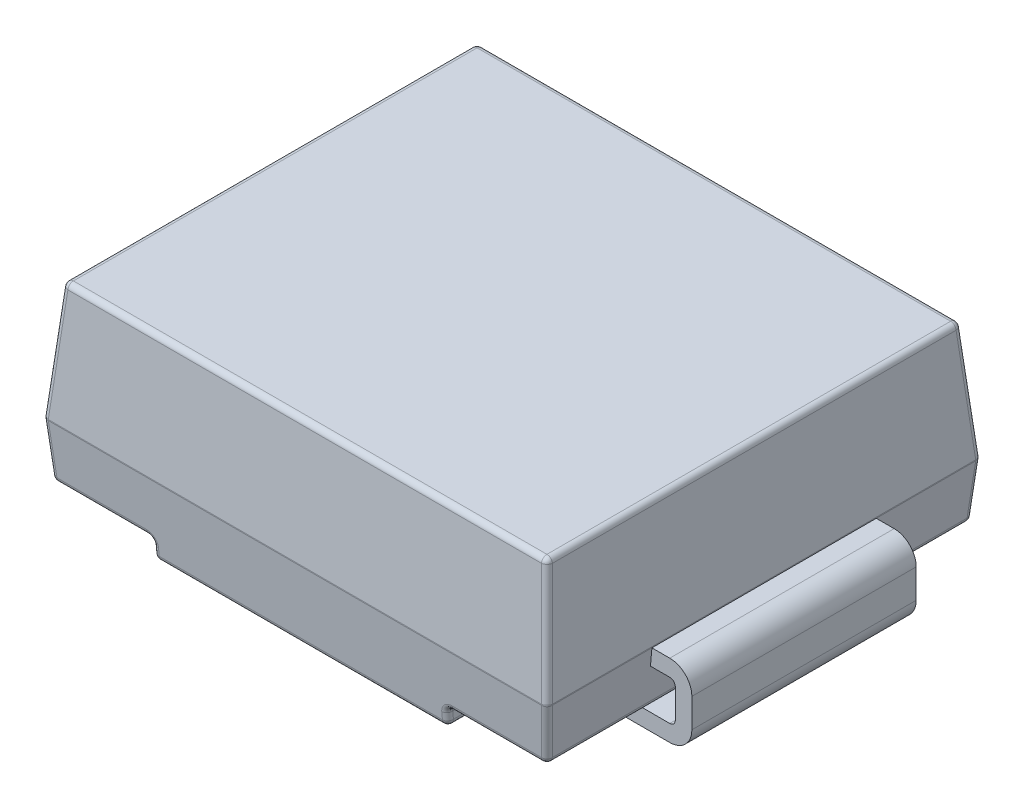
ISO-10303-21;
HEADER;
FILE_DESCRIPTION(('STEP AP214'),'2;1');
FILE_NAME('part.step','',(''),(''),'','','');
FILE_SCHEMA(('AUTOMOTIVE_DESIGN { 1 0 10303 214 1 1 1 1 }'));
ENDSEC;
DATA;
#1=APPLICATION_CONTEXT('core data for automotive mechanical design processes');
#2=APPLICATION_PROTOCOL_DEFINITION('international standard','automotive_design',2000,#1);
#3=PRODUCT_CONTEXT('',#1,'mechanical');
#4=PRODUCT('Part','Part','',(#3));
#5=PRODUCT_RELATED_PRODUCT_CATEGORY('part','',(#4));
#6=PRODUCT_DEFINITION_FORMATION('','',#4);
#7=PRODUCT_DEFINITION_CONTEXT('part definition',#1,'design');
#8=PRODUCT_DEFINITION('design','',#6,#7);
#9=PRODUCT_DEFINITION_SHAPE('','',#8);
#10=(LENGTH_UNIT() NAMED_UNIT(*) SI_UNIT(.MILLI.,.METRE.));
#11=(NAMED_UNIT(*) PLANE_ANGLE_UNIT() SI_UNIT($,.RADIAN.));
#12=(NAMED_UNIT(*) SI_UNIT($,.STERADIAN.) SOLID_ANGLE_UNIT());
#13=UNCERTAINTY_MEASURE_WITH_UNIT(LENGTH_MEASURE(1.E-05),#10,'distance_accuracy_value','');
#14=(GEOMETRIC_REPRESENTATION_CONTEXT(3) GLOBAL_UNCERTAINTY_ASSIGNED_CONTEXT((#13)) GLOBAL_UNIT_ASSIGNED_CONTEXT((#10,
#11,#12)) REPRESENTATION_CONTEXT('',''));
#15=CARTESIAN_POINT('',(0.,0.,0.));
#16=DIRECTION('',(0.,0.,1.));
#17=DIRECTION('',(1.,0.,0.));
#18=AXIS2_PLACEMENT_3D('',#15,#16,#17);
#19=CARTESIAN_POINT('',(-3.218793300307,2.525,2.743793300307));
#20=DIRECTION('',(-0.855296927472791,-0.419999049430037,-0.303427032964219));
#21=DIRECTION('',(-0.0105843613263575,0.599650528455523,-0.800191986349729));
#22=AXIS2_PLACEMENT_3D('',#19,#20,#21);
#23=SPHERICAL_SURFACE('',#22,0.075);
#24=CARTESIAN_POINT('',(-3.218793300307,2.525,2.743793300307));
#25=DIRECTION('',(0.,0.,-1.));
#26=DIRECTION('',(1.,0.,0.));
#27=AXIS2_PLACEMENT_3D('',#24,#25,#26);
#28=CIRCLE('',#27,0.075);
#29=CARTESIAN_POINT('',(-3.293507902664,2.531536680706,2.743793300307));
#30=VERTEX_POINT('',#29);
#31=CARTESIAN_POINT('',(-3.218793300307,2.6,2.743793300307));
#32=VERTEX_POINT('',#31);
#33=EDGE_CURVE('E738',#30,#32,#28,.T.);
#34=ORIENTED_EDGE('',*,*,#33,.F.);
#35=CARTESIAN_POINT('',(-3.218793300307,2.525,2.743793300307));
#36=DIRECTION('',(-0.0868265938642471,-0.992432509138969,0.0868265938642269));
#37=DIRECTION('',(0.,0.0871557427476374,0.996194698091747));
#38=AXIS2_PLACEMENT_3D('',#35,#36,#37);
#39=CIRCLE('',#38,0.075);
#40=CARTESIAN_POINT('',(-3.218793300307,2.531536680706,2.818507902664));
#41=VERTEX_POINT('',#40);
#42=EDGE_CURVE('E948',#41,#30,#39,.T.);
#43=ORIENTED_EDGE('',*,*,#42,.F.);
#44=CARTESIAN_POINT('',(-3.218793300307,2.525,2.743793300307));
#45=DIRECTION('',(1.,0.,0.));
#46=DIRECTION('',(0.,-1.,0.));
#47=AXIS2_PLACEMENT_3D('',#44,#45,#46);
#48=CIRCLE('',#47,0.075);
#49=EDGE_CURVE('E11',#32,#41,#48,.T.);
#50=ORIENTED_EDGE('',*,*,#49,.F.);
#51=EDGE_LOOP('',(#34,#43,#50));
#52=FACE_BOUND('',#51,.T.);
#53=ADVANCED_FACE('F17',(#52),#23,.T.);
#54=CARTESIAN_POINT('',(0.,2.525,2.743793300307));
#55=DIRECTION('',(1.,0.,0.));
#56=DIRECTION('',(0.,-0.737277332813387,-0.675590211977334));
#57=AXIS2_PLACEMENT_3D('',#54,#55,#56);
#58=CYLINDRICAL_SURFACE('',#57,0.075);
#59=ORIENTED_EDGE('',*,*,#49,.T.);
#60=DIRECTION('',(-1.,0.,0.));
#61=VECTOR('',#60,1.);
#62=CARTESIAN_POINT('',(-3.287518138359,2.531536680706,2.818507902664));
#63=LINE('',#62,#61);
#64=CARTESIAN_POINT('',(3.218793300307,2.531536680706,2.818507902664));
#65=VERTEX_POINT('',#64);
#66=EDGE_CURVE('E940',#65,#41,#63,.T.);
#67=ORIENTED_EDGE('',*,*,#66,.F.);
#68=CARTESIAN_POINT('',(3.218793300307,2.525,2.743793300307));
#69=DIRECTION('',(1.,0.,0.));
#70=DIRECTION('',(0.,0.,-1.));
#71=AXIS2_PLACEMENT_3D('',#68,#69,#70);
#72=CIRCLE('',#71,0.075);
#73=CARTESIAN_POINT('',(3.218793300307,2.6,2.743793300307));
#74=VERTEX_POINT('',#73);
#75=EDGE_CURVE('E43',#74,#65,#72,.T.);
#76=ORIENTED_EDGE('',*,*,#75,.F.);
#77=DIRECTION('',(1.,0.,0.));
#78=VECTOR('',#77,1.);
#79=CARTESIAN_POINT('',(3.287518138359,2.6,2.743793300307));
#80=LINE('',#79,#78);
#81=EDGE_CURVE('E29',#32,#74,#80,.T.);
#82=ORIENTED_EDGE('',*,*,#81,.F.);
#83=EDGE_LOOP('',(#59,#67,#76,#82));
#84=FACE_BOUND('',#83,.T.);
#85=ADVANCED_FACE('F1395',(#84),#58,.T.);
#86=CARTESIAN_POINT('',(0.,2.6,0.));
#87=DIRECTION('',(0.,1.,0.));
#88=DIRECTION('',(1.,0.,0.));
#89=AXIS2_PLACEMENT_3D('',#86,#87,#88);
#90=PLANE('',#89);
#91=DIRECTION('',(0.,0.,-1.));
#92=VECTOR('',#91,1.);
#93=CARTESIAN_POINT('',(3.218793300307,2.6,-2.812518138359));
#94=LINE('',#93,#92);
#95=CARTESIAN_POINT('',(3.218793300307,2.6,-2.743793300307));
#96=VERTEX_POINT('',#95);
#97=EDGE_CURVE('E993',#74,#96,#94,.T.);
#98=ORIENTED_EDGE('',*,*,#97,.T.);
#99=DIRECTION('',(-1.,0.,0.));
#100=VECTOR('',#99,1.);
#101=CARTESIAN_POINT('',(-3.287518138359,2.6,-2.743793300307));
#102=LINE('',#101,#100);
#103=CARTESIAN_POINT('',(-3.218793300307,2.6,-2.743793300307));
#104=VERTEX_POINT('',#103);
#105=EDGE_CURVE('E843',#96,#104,#102,.T.);
#106=ORIENTED_EDGE('',*,*,#105,.T.);
#107=DIRECTION('',(0.,0.,1.));
#108=VECTOR('',#107,1.);
#109=CARTESIAN_POINT('',(-3.218793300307,2.6,2.812518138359));
#110=LINE('',#109,#108);
#111=EDGE_CURVE('E846',#104,#32,#110,.T.);
#112=ORIENTED_EDGE('',*,*,#111,.T.);
#113=ORIENTED_EDGE('',*,*,#81,.T.);
#114=EDGE_LOOP('',(#98,#106,#112,#113));
#115=FACE_BOUND('',#114,.T.);
#116=ADVANCED_FACE('F1372',(#115),#90,.T.);
#117=CARTESIAN_POINT('',(3.218793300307,2.525,0.));
#118=DIRECTION('',(0.,0.,-1.));
#119=DIRECTION('',(-0.675590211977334,-0.737277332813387,0.));
#120=AXIS2_PLACEMENT_3D('',#117,#118,#119);
#121=CYLINDRICAL_SURFACE('',#120,0.075);
#122=CARTESIAN_POINT('',(3.218793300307,2.525,2.743793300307));
#123=DIRECTION('',(0.,0.,-1.));
#124=DIRECTION('',(0.,-1.,0.));
#125=AXIS2_PLACEMENT_3D('',#122,#123,#124);
#126=CIRCLE('',#125,0.075);
#127=CARTESIAN_POINT('',(3.293507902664,2.531536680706,2.743793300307));
#128=VERTEX_POINT('',#127);
#129=EDGE_CURVE('E517',#74,#128,#126,.T.);
#130=ORIENTED_EDGE('',*,*,#129,.T.);
#131=DIRECTION('',(0.,0.,1.));
#132=VECTOR('',#131,1.);
#133=CARTESIAN_POINT('',(3.293507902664,2.531536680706,2.812518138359));
#134=LINE('',#133,#132);
#135=CARTESIAN_POINT('',(3.293507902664,2.531536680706,-2.743793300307));
#136=VERTEX_POINT('',#135);
#137=EDGE_CURVE('E509',#136,#128,#134,.T.);
#138=ORIENTED_EDGE('',*,*,#137,.F.);
#139=CARTESIAN_POINT('',(3.218793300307,2.525,-2.743793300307));
#140=DIRECTION('',(0.,0.,-1.));
#141=DIRECTION('',(-1.,0.,0.));
#142=AXIS2_PLACEMENT_3D('',#139,#140,#141);
#143=CIRCLE('',#142,0.075);
#144=EDGE_CURVE('E514',#96,#136,#143,.T.);
#145=ORIENTED_EDGE('',*,*,#144,.F.);
#146=ORIENTED_EDGE('',*,*,#97,.F.);
#147=EDGE_LOOP('',(#130,#138,#145,#146));
#148=FACE_BOUND('',#147,.T.);
#149=ADVANCED_FACE('F511',(#148),#121,.T.);
#150=CARTESIAN_POINT('',(0.,2.525,-2.743793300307));
#151=DIRECTION('',(-1.,0.,0.));
#152=DIRECTION('',(0.,-0.737277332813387,0.675590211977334));
#153=AXIS2_PLACEMENT_3D('',#150,#151,#152);
#154=CYLINDRICAL_SURFACE('',#153,0.075);
#155=CARTESIAN_POINT('',(-3.218793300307,2.525,-2.743793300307));
#156=DIRECTION('',(1.,0.,0.));
#157=DIRECTION('',(0.,0.,1.));
#158=AXIS2_PLACEMENT_3D('',#155,#156,#157);
#159=CIRCLE('',#158,0.075);
#160=CARTESIAN_POINT('',(-3.218793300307,2.531536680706,-2.818507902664));
#161=VERTEX_POINT('',#160);
#162=EDGE_CURVE('E609',#161,#104,#159,.T.);
#163=ORIENTED_EDGE('',*,*,#162,.T.);
#164=ORIENTED_EDGE('',*,*,#105,.F.);
#165=CARTESIAN_POINT('',(3.218793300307,2.525,-2.743793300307));
#166=DIRECTION('',(1.,0.,0.));
#167=DIRECTION('',(0.,0.,-1.));
#168=AXIS2_PLACEMENT_3D('',#165,#166,#167);
#169=CIRCLE('',#168,0.075);
#170=CARTESIAN_POINT('',(3.218793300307,2.531536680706,-2.818507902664));
#171=VERTEX_POINT('',#170);
#172=EDGE_CURVE('E538',#171,#96,#169,.T.);
#173=ORIENTED_EDGE('',*,*,#172,.F.);
#174=DIRECTION('',(1.,0.,0.));
#175=VECTOR('',#174,1.);
#176=CARTESIAN_POINT('',(3.287518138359,2.531536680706,-2.818507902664));
#177=LINE('',#176,#175);
#178=EDGE_CURVE('E1181',#161,#171,#177,.T.);
#179=ORIENTED_EDGE('',*,*,#178,.F.);
#180=EDGE_LOOP('',(#163,#164,#173,#179));
#181=FACE_BOUND('',#180,.T.);
#182=ADVANCED_FACE('F19',(#181),#154,.T.);
#183=CARTESIAN_POINT('',(-3.218793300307,2.525,0.));
#184=DIRECTION('',(0.,0.,1.));
#185=DIRECTION('',(0.675590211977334,-0.737277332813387,0.));
#186=AXIS2_PLACEMENT_3D('',#183,#184,#185);
#187=CYLINDRICAL_SURFACE('',#186,0.075);
#188=ORIENTED_EDGE('',*,*,#33,.T.);
#189=ORIENTED_EDGE('',*,*,#111,.F.);
#190=CARTESIAN_POINT('',(-3.218793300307,2.525,-2.743793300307));
#191=DIRECTION('',(0.,0.,-1.));
#192=DIRECTION('',(-1.,0.,0.));
#193=AXIS2_PLACEMENT_3D('',#190,#191,#192);
#194=CIRCLE('',#193,0.075);
#195=CARTESIAN_POINT('',(-3.293507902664,2.531536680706,-2.743793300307));
#196=VERTEX_POINT('',#195);
#197=EDGE_CURVE('E598',#196,#104,#194,.T.);
#198=ORIENTED_EDGE('',*,*,#197,.F.);
#199=DIRECTION('',(0.,0.,-1.));
#200=VECTOR('',#199,1.);
#201=CARTESIAN_POINT('',(-3.293507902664,2.531536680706,-2.812518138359));
#202=LINE('',#201,#200);
#203=EDGE_CURVE('E734',#30,#196,#202,.T.);
#204=ORIENTED_EDGE('',*,*,#203,.F.);
#205=EDGE_LOOP('',(#188,#189,#198,#204));
#206=FACE_BOUND('',#205,.T.);
#207=ADVANCED_FACE('F3141',(#206),#187,.T.);
#208=CARTESIAN_POINT('',(-3.4275,1.,2.9525));
#209=DIRECTION('',(-0.996194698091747,0.0871557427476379,0.));
#210=DIRECTION('',(0.,0.,1.));
#211=AXIS2_PLACEMENT_3D('',#208,#209,#210);
#212=PLANE('',#211);
#213=ORIENTED_EDGE('',*,*,#203,.T.);
#214=DIRECTION('',(-0.0868265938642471,-0.992432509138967,-0.0868265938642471));
#215=VECTOR('',#214,1.);
#216=CARTESIAN_POINT('',(-3.383546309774,1.502392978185,-2.833831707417));
#217=LINE('',#216,#215);
#218=CARTESIAN_POINT('',(-3.426928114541,1.006536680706,-2.877213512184));
#219=VERTEX_POINT('',#218);
#220=EDGE_CURVE('E739',#196,#219,#217,.T.);
#221=ORIENTED_EDGE('',*,*,#220,.T.);
#222=DIRECTION('',(0.,0.,1.));
#223=VECTOR('',#222,1.);
#224=CARTESIAN_POINT('',(-3.426928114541,1.006536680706,2.9525));
#225=LINE('',#224,#223);
#226=CARTESIAN_POINT('',(-3.426928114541,1.006536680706,2.877213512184));
#227=VERTEX_POINT('',#226);
#228=EDGE_CURVE('E997',#219,#227,#225,.T.);
#229=ORIENTED_EDGE('',*,*,#228,.T.);
#230=DIRECTION('',(0.0868265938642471,0.992432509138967,-0.0868265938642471));
#231=VECTOR('',#230,1.);
#232=CARTESIAN_POINT('',(-3.428063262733,0.993561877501,2.878348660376));
#233=LINE('',#232,#231);
#234=EDGE_CURVE('E951',#227,#30,#233,.T.);
#235=ORIENTED_EDGE('',*,*,#234,.T.);
#236=EDGE_LOOP('',(#213,#221,#229,#235));
#237=FACE_BOUND('',#236,.T.);
#238=ADVANCED_FACE('F3132',(#237),#212,.T.);
#239=CARTESIAN_POINT('',(-3.308831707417,1.495856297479,-2.833831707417));
#240=DIRECTION('',(-0.0868265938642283,-0.992432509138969,-0.0868265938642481));
#241=DIRECTION('',(0.701755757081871,-0.122791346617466,0.70175575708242));
#242=AXIS2_PLACEMENT_3D('',#239,#240,#241);
#243=CYLINDRICAL_SURFACE('',#242,0.075);
#244=ORIENTED_EDGE('',*,*,#220,.F.);
#245=CARTESIAN_POINT('',(-3.218793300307,2.525,-2.743793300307));
#246=DIRECTION('',(-0.0868265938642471,-0.992432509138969,-0.0868265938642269));
#247=DIRECTION('',(0.,-0.0871557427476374,0.996194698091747));
#248=AXIS2_PLACEMENT_3D('',#245,#246,#247);
#249=CIRCLE('',#248,0.075);
#250=EDGE_CURVE('E540',#196,#161,#249,.T.);
#251=ORIENTED_EDGE('',*,*,#250,.T.);
#252=DIRECTION('',(0.0868265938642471,0.992432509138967,0.0868265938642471));
#253=VECTOR('',#252,1.);
#254=CARTESIAN_POINT('',(-3.301669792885,1.584254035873,-2.901384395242));
#255=LINE('',#254,#253);
#256=CARTESIAN_POINT('',(-3.352213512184,1.006536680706,-2.951928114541));
#257=VERTEX_POINT('',#256);
#258=EDGE_CURVE('E1185',#257,#161,#255,.T.);
#259=ORIENTED_EDGE('',*,*,#258,.F.);
#260=CARTESIAN_POINT('',(-3.352213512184,1.,-2.877213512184));
#261=DIRECTION('',(-0.0868265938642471,-0.992432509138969,-0.0868265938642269));
#262=DIRECTION('',(0.,0.0871557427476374,-0.996194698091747));
#263=AXIS2_PLACEMENT_3D('',#260,#261,#262);
#264=CIRCLE('',#263,0.075);
#265=EDGE_CURVE('E728',#219,#257,#264,.T.);
#266=ORIENTED_EDGE('',*,*,#265,.F.);
#267=EDGE_LOOP('',(#244,#251,#259,#266));
#268=FACE_BOUND('',#267,.T.);
#269=ADVANCED_FACE('F2681',(#268),#243,.T.);
#270=CARTESIAN_POINT('',(3.4275,1.,-2.9525));
#271=DIRECTION('',(0.,0.0871557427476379,-0.996194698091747));
#272=DIRECTION('',(-1.,0.,0.));
#273=AXIS2_PLACEMENT_3D('',#270,#271,#272);
#274=PLANE('',#273);
#275=ORIENTED_EDGE('',*,*,#178,.T.);
#276=DIRECTION('',(0.0868265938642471,-0.992432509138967,-0.0868265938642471));
#277=VECTOR('',#276,1.);
#278=CARTESIAN_POINT('',(3.353348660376,0.993561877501,-2.953063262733));
#279=LINE('',#278,#277);
#280=CARTESIAN_POINT('',(3.352213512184,1.006536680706,-2.951928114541));
#281=VERTEX_POINT('',#280);
#282=EDGE_CURVE('E545',#171,#281,#279,.T.);
#283=ORIENTED_EDGE('',*,*,#282,.T.);
#284=DIRECTION('',(-1.,0.,0.));
#285=VECTOR('',#284,1.);
#286=CARTESIAN_POINT('',(-3.4275,1.006536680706,-2.951928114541));
#287=LINE('',#286,#285);
#288=EDGE_CURVE('E935',#281,#257,#287,.T.);
#289=ORIENTED_EDGE('',*,*,#288,.T.);
#290=ORIENTED_EDGE('',*,*,#258,.T.);
#291=EDGE_LOOP('',(#275,#283,#289,#290));
#292=FACE_BOUND('',#291,.T.);
#293=ADVANCED_FACE('F2677',(#292),#274,.T.);
#294=CARTESIAN_POINT('',(3.353348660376,0.987025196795,-2.878348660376));
#295=DIRECTION('',(0.086826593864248,-0.992432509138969,-0.0868265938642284));
#296=DIRECTION('',(-0.701755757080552,-0.122791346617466,0.701755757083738));
#297=AXIS2_PLACEMENT_3D('',#294,#295,#296);
#298=CYLINDRICAL_SURFACE('',#297,0.075);
#299=ORIENTED_EDGE('',*,*,#282,.F.);
#300=CARTESIAN_POINT('',(3.218793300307,2.525,-2.743793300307));
#301=DIRECTION('',(0.0868265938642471,-0.992432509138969,-0.0868265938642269));
#302=DIRECTION('',(0.,-0.0871557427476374,0.996194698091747));
#303=AXIS2_PLACEMENT_3D('',#300,#301,#302);
#304=CIRCLE('',#303,0.075);
#305=EDGE_CURVE('E536',#171,#136,#304,.T.);
#306=ORIENTED_EDGE('',*,*,#305,.T.);
#307=DIRECTION('',(-0.0868265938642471,0.992432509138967,0.0868265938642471));
#308=VECTOR('',#307,1.);
#309=CARTESIAN_POINT('',(3.383546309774,1.502392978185,-2.833831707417));
#310=LINE('',#309,#308);
#311=CARTESIAN_POINT('',(3.426928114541,1.006536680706,-2.877213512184));
#312=VERTEX_POINT('',#311);
#313=EDGE_CURVE('E523',#312,#136,#310,.T.);
#314=ORIENTED_EDGE('',*,*,#313,.F.);
#315=CARTESIAN_POINT('',(3.352213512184,1.,-2.877213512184));
#316=DIRECTION('',(0.0868265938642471,-0.992432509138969,-0.0868265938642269));
#317=DIRECTION('',(0.,0.0871557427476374,-0.996194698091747));
#318=AXIS2_PLACEMENT_3D('',#315,#316,#317);
#319=CIRCLE('',#318,0.075);
#320=EDGE_CURVE('E612',#281,#312,#319,.T.);
#321=ORIENTED_EDGE('',*,*,#320,.F.);
#322=EDGE_LOOP('',(#299,#306,#314,#321));
#323=FACE_BOUND('',#322,.T.);
#324=ADVANCED_FACE('F543',(#323),#298,.T.);
#325=CARTESIAN_POINT('',(3.4275,1.,-2.877213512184));
#326=DIRECTION('',(-1.,0.,0.));
#327=DIRECTION('',(0.,0.,1.));
#328=AXIS2_PLACEMENT_3D('',#325,#326,#327);
#329=CYLINDRICAL_SURFACE('',#328,0.075);
#330=CARTESIAN_POINT('',(-3.352213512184,1.,-2.877213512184));
#331=DIRECTION('',(1.,0.,0.));
#332=DIRECTION('',(0.,-1.,0.));
#333=AXIS2_PLACEMENT_3D('',#330,#331,#332);
#334=CIRCLE('',#333,0.075);
#335=CARTESIAN_POINT('',(-3.352213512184,0.993463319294,-2.951928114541));
#336=VERTEX_POINT('',#335);
#337=EDGE_CURVE('E725',#336,#257,#334,.T.);
#338=ORIENTED_EDGE('',*,*,#337,.T.);
#339=ORIENTED_EDGE('',*,*,#288,.F.);
#340=CARTESIAN_POINT('',(3.352213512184,1.,-2.877213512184));
#341=DIRECTION('',(1.,0.,0.));
#342=DIRECTION('',(0.,1.,0.));
#343=AXIS2_PLACEMENT_3D('',#340,#341,#342);
#344=CIRCLE('',#343,0.075);
#345=CARTESIAN_POINT('',(3.352213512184,0.993463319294,-2.951928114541));
#346=VERTEX_POINT('',#345);
#347=EDGE_CURVE('E786',#346,#281,#344,.T.);
#348=ORIENTED_EDGE('',*,*,#347,.F.);
#349=DIRECTION('',(1.,0.,0.));
#350=VECTOR('',#349,1.);
#351=CARTESIAN_POINT('',(3.4275,0.993463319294,-2.951928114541));
#352=LINE('',#351,#350);
#353=EDGE_CURVE('E651',#336,#346,#352,.T.);
#354=ORIENTED_EDGE('',*,*,#353,.F.);
#355=EDGE_LOOP('',(#338,#339,#348,#354));
#356=FACE_BOUND('',#355,.T.);
#357=ADVANCED_FACE('F1240',(#356),#329,.T.);
#358=CARTESIAN_POINT('',(-1.925,0.075,2.796286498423));
#359=DIRECTION('',(-0.843069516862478,0.511967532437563,-0.164690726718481));
#360=DIRECTION('',(-0.154199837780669,-0.523483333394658,-0.837966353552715));
#361=AXIS2_PLACEMENT_3D('',#358,#359,#360);
#362=SPHERICAL_SURFACE('',#361,0.075);
#363=CARTESIAN_POINT('',(-1.925,0.075,2.796286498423));
#364=DIRECTION('',(0.,0.,-1.));
#365=DIRECTION('',(0.,-1.,0.));
#366=AXIS2_PLACEMENT_3D('',#363,#364,#365);
#367=CIRCLE('',#366,0.075);
#368=CARTESIAN_POINT('',(-1.925,0.,2.796286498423));
#369=VERTEX_POINT('',#368);
#370=CARTESIAN_POINT('',(-2.,0.075,2.796286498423));
#371=VERTEX_POINT('',#370);
#372=EDGE_CURVE('E1169',#369,#371,#367,.T.);
#373=ORIENTED_EDGE('',*,*,#372,.F.);
#374=CARTESIAN_POINT('',(-1.925,0.075,2.796286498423));
#375=DIRECTION('',(1.,0.,0.));
#376=DIRECTION('',(0.,0.,1.));
#377=AXIS2_PLACEMENT_3D('',#374,#375,#376);
#378=CIRCLE('',#377,0.075);
#379=CARTESIAN_POINT('',(-1.925,0.06846331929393,2.87100110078));
#380=VERTEX_POINT('',#379);
#381=EDGE_CURVE('E1150',#380,#369,#378,.T.);
#382=ORIENTED_EDGE('',*,*,#381,.F.);
#383=CARTESIAN_POINT('',(-1.925,0.075,2.796286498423));
#384=DIRECTION('',(0.,-0.996194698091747,-0.087155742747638));
#385=DIRECTION('',(0.,0.087155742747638,-0.996194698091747));
#386=AXIS2_PLACEMENT_3D('',#383,#384,#385);
#387=CIRCLE('',#386,0.075);
#388=EDGE_CURVE('E932',#380,#371,#387,.T.);
#389=ORIENTED_EDGE('',*,*,#388,.T.);
#390=EDGE_LOOP('',(#373,#382,#389));
#391=FACE_BOUND('',#390,.T.);
#392=ADVANCED_FACE('F1243',(#391),#362,.T.);
#393=CARTESIAN_POINT('',(-1.925,-0.546677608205,2.741896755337));
#394=DIRECTION('',(0.,-0.996194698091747,-0.087155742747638));
#395=DIRECTION('',(0.707106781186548,0.0616284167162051,-0.70441602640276));
#396=AXIS2_PLACEMENT_3D('',#393,#394,#395);
#397=CYLINDRICAL_SURFACE('',#396,0.075);
#398=CARTESIAN_POINT('',(-1.925,0.176517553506,2.805168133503));
#399=DIRECTION('',(0.,-0.996194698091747,-0.0871557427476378));
#400=DIRECTION('',(0.,-0.0871557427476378,0.996194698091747));
#401=AXIS2_PLACEMENT_3D('',#398,#399,#400);
#402=CIRCLE('',#401,0.075);
#403=CARTESIAN_POINT('',(-1.925,0.1699808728,2.87988273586));
#404=VERTEX_POINT('',#403);
#405=CARTESIAN_POINT('',(-2.,0.176517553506,2.805168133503));
#406=VERTEX_POINT('',#405);
#407=EDGE_CURVE('E936',#404,#406,#402,.T.);
#408=ORIENTED_EDGE('',*,*,#407,.T.);
#409=DIRECTION('',(0.,0.996194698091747,0.0871557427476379));
#410=VECTOR('',#409,1.);
#411=CARTESIAN_POINT('',(-2.,0.258054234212,2.812301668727));
#412=LINE('',#411,#410);
#413=EDGE_CURVE('E2039',#371,#406,#412,.T.);
#414=ORIENTED_EDGE('',*,*,#413,.F.);
#415=ORIENTED_EDGE('',*,*,#388,.F.);
#416=DIRECTION('',(0.,-0.996194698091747,-0.0871557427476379));
#417=VECTOR('',#416,1.);
#418=CARTESIAN_POINT('',(-1.925,0.,2.865011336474));
#419=LINE('',#418,#417);
#420=EDGE_CURVE('E1118',#404,#380,#419,.T.);
#421=ORIENTED_EDGE('',*,*,#420,.F.);
#422=EDGE_LOOP('',(#408,#414,#415,#421));
#423=FACE_BOUND('',#422,.T.);
#424=ADVANCED_FACE('F1308',(#423),#397,.T.);
#425=CARTESIAN_POINT('',(-1.92479070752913,0.1699808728,2.87988273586));
#426=CARTESIAN_POINT('',(-1.9248952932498,0.1699808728,2.87988273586));
#427=CARTESIAN_POINT('',(-1.92500265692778,0.1699808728,2.87988273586));
#428=CARTESIAN_POINT('',(-2.,0.169981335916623,2.87987744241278));
#429=CARTESIAN_POINT('',(-2.,0.176517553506,2.805168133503));
#430=CARTESIAN_POINT('',(-1.92479579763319,0.251805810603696,2.88704149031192));
#431=CARTESIAN_POINT('',(-1.92489784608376,0.25174683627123,2.88703633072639));
#432=CARTESIAN_POINT('',(-1.9250025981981,0.251686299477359,2.8870310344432));
#433=CARTESIAN_POINT('',(-1.9965070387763,0.210364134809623,2.88341084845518));
#434=CARTESIAN_POINT('',(-2.,0.217371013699,2.812316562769));
#435=CARTESIAN_POINT('',(-1.99318642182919,0.320180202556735,2.89302347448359));
#436=CARTESIAN_POINT('',(-1.99323972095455,0.320080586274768,2.89301475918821));
#437=CARTESIAN_POINT('',(-1.99329442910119,0.319978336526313,2.89300581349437));
#438=CARTESIAN_POINT('',(-2.02992427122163,0.251517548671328,2.88701160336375));
#439=CARTESIAN_POINT('',(-2.034146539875,0.251517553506,2.818291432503));
#440=CARTESIAN_POINT('',(-2.075,0.320180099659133,2.89302346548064));
#441=CARTESIAN_POINT('',(-2.075,0.320080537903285,2.89301475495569));
#442=CARTESIAN_POINT('',(-2.075,0.319978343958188,2.89300581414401));
#443=CARTESIAN_POINT('',(-2.075,0.251517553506,2.88701160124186));
#444=CARTESIAN_POINT('',(-2.075,0.251517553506,2.818291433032));
#445=(BOUNDED_SURFACE() B_SPLINE_SURFACE(3,2,((#425,#426,#427,#428,#429),(#430,#431,#432,#433,
#434),(#435,#436,#437,#438,#439),(#440,#441,#442,#443,#444)),.UNSPECIFIED.,.F.,.F.,
.F.) B_SPLINE_SURFACE_WITH_KNOTS((4,4),(3,1,1,3),(1.570796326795,3.14159265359),
(-0.00197551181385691,0.,5.00987755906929E-05,1.),
.UNSPECIFIED.) GEOMETRIC_REPRESENTATION_ITEM() RATIONAL_B_SPLINE_SURFACE(((1.00115722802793,
1.00057861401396,0.999985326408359,0.707121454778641,1.),(1.00109211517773,1.00054605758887,
0.999986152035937,0.723600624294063,1.),(1.00103643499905,1.00051821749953,0.999986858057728,
0.737692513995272,1.),(1.0010380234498,1.0005190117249,0.999986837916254,0.737290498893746,1.))) REPRESENTATION_ITEM('') SURFACE());
#446=CARTESIAN_POINT('',(-1.925,0.1699808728,2.87988273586));
#447=CARTESIAN_POINT('',(-1.925,0.205336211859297,2.88297592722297));
#448=CARTESIAN_POINT('',(-1.94017467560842,0.246438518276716,2.88657191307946));
#449=CARTESIAN_POINT('',(-1.99844330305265,0.304916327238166,2.89168805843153));
#450=CARTESIAN_POINT('',(-2.0396446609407,0.3199808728,2.89300603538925));
#451=CARTESIAN_POINT('',(-2.075,0.3199808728,2.893006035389));
#452=B_SPLINE_CURVE_WITH_KNOTS('',3,(#446,#447,#448,#449,#450,#451),.UNSPECIFIED.,.F.,.F.,(4,2,
4),(0.,0.5,1.),.UNSPECIFIED.);
#453=CARTESIAN_POINT('',(-2.075,0.3199808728,2.893006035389));
#454=VERTEX_POINT('',#453);
#455=EDGE_CURVE('E1117',#404,#454,#452,.T.);
#456=CARTESIAN_POINT('',(-2.075,0.326517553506,2.818291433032));
#457=DIRECTION('',(1.,0.,0.));
#458=DIRECTION('',(0.,0.,-1.));
#459=AXIS2_PLACEMENT_3D('',#456,#457,#458);
#460=CIRCLE('',#459,0.075);
#461=CARTESIAN_POINT('',(-2.075,0.251517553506,2.818291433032));
#462=VERTEX_POINT('',#461);
#463=EDGE_CURVE('E1112',#454,#462,#460,.T.);
#464=CARTESIAN_POINT('',(-2.075,0.251517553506,2.818291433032));
#465=CARTESIAN_POINT('',(-2.034146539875,0.251517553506,2.818291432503));
#466=CARTESIAN_POINT('',(-2.,0.217371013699,2.812316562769));
#467=CARTESIAN_POINT('',(-2.,0.176517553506,2.805168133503));
#468=(BOUNDED_CURVE() B_SPLINE_CURVE(3,(#464,#465,#466,#467),.UNSPECIFIED.,.F.,
.F.) B_SPLINE_CURVE_WITH_KNOTS((4,4),(1.570796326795,3.14159265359),
.UNSPECIFIED.) CURVE() GEOMETRIC_REPRESENTATION_ITEM() RATIONAL_B_SPLINE_CURVE((1.,1.,1.,1.)) REPRESENTATION_ITEM(''));
#469=EDGE_CURVE('E2526',#406,#462,#468,.F.);
#470=ORIENTED_EDGE('',*,*,#455,.T.);
#471=ORIENTED_EDGE('',*,*,#463,.T.);
#472=ORIENTED_EDGE('',*,*,#469,.F.);
#473=ORIENTED_EDGE('',*,*,#407,.F.);
#474=EDGE_LOOP('',(#470,#471,#472,#473));
#475=FACE_BOUND('',#474,.T.);
#476=ADVANCED_FACE('F1225',(#475),#445,.T.);
#477=CARTESIAN_POINT('',(-2.075,0.320181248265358,-2.89302356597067));
#478=CARTESIAN_POINT('',(-2.075,0.320081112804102,-2.89301480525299));
#479=CARTESIAN_POINT('',(-2.075,0.319978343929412,-2.89300581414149));
#480=CARTESIAN_POINT('',(-2.075,0.251517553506,-2.88701160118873));
#481=CARTESIAN_POINT('',(-2.075,0.251517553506,-2.818291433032));
#482=CARTESIAN_POINT('',(-1.9931858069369,0.320181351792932,-2.89302357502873));
#483=CARTESIAN_POINT('',(-1.99323941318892,0.320081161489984,-2.89301480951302));
#484=CARTESIAN_POINT('',(-1.9932944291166,0.319978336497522,-2.89300581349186));
#485=CARTESIAN_POINT('',(-2.02992427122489,0.251517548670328,-2.88701160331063));
#486=CARTESIAN_POINT('',(-2.034146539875,0.251517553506,-2.818291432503));
#487=CARTESIAN_POINT('',(-1.92479462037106,0.251806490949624,-2.88704154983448));
#488=CARTESIAN_POINT('',(-1.92489725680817,0.251747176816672,-2.88703636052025));
#489=CARTESIAN_POINT('',(-1.9250025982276,0.251686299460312,-2.88703103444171));
#490=CARTESIAN_POINT('',(-1.99650703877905,0.210364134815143,-2.88341084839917));
#491=CARTESIAN_POINT('',(-2.,0.217371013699,-2.812316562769));
#492=CARTESIAN_POINT('',(-1.92478950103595,0.1699808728,-2.87988273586));
#493=CARTESIAN_POINT('',(-1.92489468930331,0.1699808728,-2.87988273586));
#494=CARTESIAN_POINT('',(-1.92500265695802,0.1699808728,-2.87988273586));
#495=CARTESIAN_POINT('',(-2.,0.169981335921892,-2.87987744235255));
#496=CARTESIAN_POINT('',(-2.,0.176517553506,-2.805168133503));
#497=(BOUNDED_SURFACE() B_SPLINE_SURFACE(3,2,((#477,#478,#479,#480,#481),(#482,#483,#484,#485,
#486),(#487,#488,#489,#490,#491),(#492,#493,#494,#495,#496)),.UNSPECIFIED.,.F.,.F.,
.F.) B_SPLINE_SURFACE_WITH_KNOTS((4,4),(3,1,1,3),(0.,1.570796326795),(-0.00198691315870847,0.,
5.00993456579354E-05,1.),
.UNSPECIFIED.) GEOMETRIC_REPRESENTATION_ITEM() RATIONAL_B_SPLINE_SURFACE(((1.00104401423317,
1.00052200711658,0.999986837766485,0.737290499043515,1.),(1.00104241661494,1.00052120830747,
0.999986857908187,0.737692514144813,1.),(1.0010984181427,1.00054920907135,0.999986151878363,
0.723600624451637,1.),(1.00116390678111,1.00058195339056,0.99998532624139,0.70712145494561,1.))) REPRESENTATION_ITEM('') SURFACE());
#498=CARTESIAN_POINT('',(-2.075,0.326517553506,-2.818291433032));
#499=DIRECTION('',(1.,0.,0.));
#500=DIRECTION('',(0.,0.,-1.));
#501=AXIS2_PLACEMENT_3D('',#498,#499,#500);
#502=CIRCLE('',#501,0.075);
#503=CARTESIAN_POINT('',(-2.075,0.251517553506,-2.818291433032));
#504=VERTEX_POINT('',#503);
#505=CARTESIAN_POINT('',(-2.075,0.3199808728,-2.893006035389));
#506=VERTEX_POINT('',#505);
#507=EDGE_CURVE('E1053',#504,#506,#502,.T.);
#508=CARTESIAN_POINT('',(-2.075,0.3199808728,-2.893006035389));
#509=CARTESIAN_POINT('',(-2.03964466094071,0.3199808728,-2.89300603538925));
#510=CARTESIAN_POINT('',(-1.99855165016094,0.304810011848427,-2.89167875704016));
#511=CARTESIAN_POINT('',(-1.94006570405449,0.246545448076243,-2.88658126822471));
#512=CARTESIAN_POINT('',(-1.925,0.205336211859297,-2.88297592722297));
#513=CARTESIAN_POINT('',(-1.925,0.1699808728,-2.87988273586));
#514=B_SPLINE_CURVE_WITH_KNOTS('',3,(#508,#509,#510,#511,#512,#513),.UNSPECIFIED.,.F.,.F.,(4,2,
4),(0.,0.5,1.),.UNSPECIFIED.);
#515=CARTESIAN_POINT('',(-1.925,0.1699808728,-2.87988273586));
#516=VERTEX_POINT('',#515);
#517=EDGE_CURVE('E744',#506,#516,#514,.T.);
#518=CARTESIAN_POINT('',(-1.925,0.176517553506,-2.805168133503));
#519=DIRECTION('',(0.,-0.996194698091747,0.0871557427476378));
#520=DIRECTION('',(0.,0.0871557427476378,0.996194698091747));
#521=AXIS2_PLACEMENT_3D('',#518,#519,#520);
#522=CIRCLE('',#521,0.075);
#523=CARTESIAN_POINT('',(-2.,0.176517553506,-2.805168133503));
#524=VERTEX_POINT('',#523);
#525=EDGE_CURVE('E898',#524,#516,#522,.T.);
#526=CARTESIAN_POINT('',(-2.,0.176517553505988,-2.80516813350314));
#527=CARTESIAN_POINT('',(-1.99999999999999,0.217371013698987,-2.81231656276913));
#528=CARTESIAN_POINT('',(-2.03414653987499,0.251517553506,-2.81829143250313));
#529=CARTESIAN_POINT('',(-2.075,0.251517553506,-2.81829143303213));
#530=(BOUNDED_CURVE() B_SPLINE_CURVE(3,(#526,#527,#528,#529),.UNSPECIFIED.,.F.,
.F.) B_SPLINE_CURVE_WITH_KNOTS((4,4),(0.,1.570796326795),
.UNSPECIFIED.) CURVE() GEOMETRIC_REPRESENTATION_ITEM() RATIONAL_B_SPLINE_CURVE((0.999999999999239,
0.999999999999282,0.999999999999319,0.999999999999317)) REPRESENTATION_ITEM(''));
#531=EDGE_CURVE('E1205',#524,#504,#530,.T.);
#532=ORIENTED_EDGE('',*,*,#507,.T.);
#533=ORIENTED_EDGE('',*,*,#517,.T.);
#534=ORIENTED_EDGE('',*,*,#525,.F.);
#535=ORIENTED_EDGE('',*,*,#531,.T.);
#536=EDGE_LOOP('',(#532,#533,#534,#535));
#537=FACE_BOUND('',#536,.T.);
#538=ADVANCED_FACE('F1212',(#537),#497,.T.);
#539=CARTESIAN_POINT('',(-2.075,0.176517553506,-2.9525));
#540=DIRECTION('',(0.,0.,-1.));
#541=DIRECTION('',(-0.707106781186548,-0.707106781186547,0.));
#542=AXIS2_PLACEMENT_3D('',#539,#540,#541);
#543=CYLINDRICAL_SURFACE('',#542,0.075);
#544=ORIENTED_EDGE('',*,*,#469,.T.);
#545=DIRECTION('',(0.,0.,1.));
#546=VECTOR('',#545,1.);
#547=CARTESIAN_POINT('',(-2.075,0.251517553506,2.887016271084));
#548=LINE('',#547,#546);
#549=EDGE_CURVE('E2348',#504,#462,#548,.T.);
#550=ORIENTED_EDGE('',*,*,#549,.F.);
#551=ORIENTED_EDGE('',*,*,#531,.F.);
#552=DIRECTION('',(0.,0.,-1.));
#553=VECTOR('',#552,1.);
#554=CARTESIAN_POINT('',(-2.,0.176517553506,-2.887016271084));
#555=LINE('',#554,#553);
#556=EDGE_CURVE('E2518',#406,#524,#555,.T.);
#557=ORIENTED_EDGE('',*,*,#556,.F.);
#558=EDGE_LOOP('',(#544,#550,#551,#557));
#559=FACE_BOUND('',#558,.T.);
#560=ADVANCED_FACE('F1224',(#559),#543,.F.);
#561=CARTESIAN_POINT('',(-2.,-0.04848244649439,-2.9525));
#562=DIRECTION('',(1.,0.,0.));
#563=DIRECTION('',(0.,1.,0.));
#564=AXIS2_PLACEMENT_3D('',#561,#562,#563);
#565=PLANE('',#564);
#566=DIRECTION('',(0.,-0.996194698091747,0.0871557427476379));
#567=VECTOR('',#566,1.);
#568=CARTESIAN_POINT('',(-2.,0.006536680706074,-2.790296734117));
#569=LINE('',#568,#567);
#570=CARTESIAN_POINT('',(-2.,0.075,-2.796286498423));
#571=VERTEX_POINT('',#570);
#572=EDGE_CURVE('E2035',#524,#571,#569,.T.);
#573=ORIENTED_EDGE('',*,*,#572,.T.);
#574=DIRECTION('',(0.,0.,1.));
#575=VECTOR('',#574,1.);
#576=CARTESIAN_POINT('',(-2.,0.075,-2.9525));
#577=LINE('',#576,#575);
#578=EDGE_CURVE('E899',#571,#371,#577,.T.);
#579=ORIENTED_EDGE('',*,*,#578,.T.);
#580=ORIENTED_EDGE('',*,*,#413,.T.);
#581=ORIENTED_EDGE('',*,*,#556,.T.);
#582=EDGE_LOOP('',(#573,#579,#580,#581));
#583=FACE_BOUND('',#582,.T.);
#584=ADVANCED_FACE('F1245',(#583),#565,.F.);
#585=CARTESIAN_POINT('',(-1.925,-0.03398136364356,-2.786751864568));
#586=DIRECTION('',(0.,0.996194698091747,-0.0871557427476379));
#587=DIRECTION('',(0.707106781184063,0.0616284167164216,0.704416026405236));
#588=AXIS2_PLACEMENT_3D('',#585,#586,#587);
#589=CYLINDRICAL_SURFACE('',#588,0.075);
#590=ORIENTED_EDGE('',*,*,#525,.T.);
#591=DIRECTION('',(0.,0.996194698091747,-0.0871557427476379));
#592=VECTOR('',#591,1.);
#593=CARTESIAN_POINT('',(-1.925,0.251517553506,-2.887016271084));
#594=LINE('',#593,#592);
#595=CARTESIAN_POINT('',(-1.925,0.06846331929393,-2.87100110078));
#596=VERTEX_POINT('',#595);
#597=EDGE_CURVE('E804',#596,#516,#594,.T.);
#598=ORIENTED_EDGE('',*,*,#597,.F.);
#599=CARTESIAN_POINT('',(-1.925,0.075,-2.796286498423));
#600=DIRECTION('',(0.,-0.996194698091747,0.087155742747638));
#601=DIRECTION('',(0.,-0.087155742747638,-0.996194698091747));
#602=AXIS2_PLACEMENT_3D('',#599,#600,#601);
#603=CIRCLE('',#602,0.075);
#604=EDGE_CURVE('E682',#571,#596,#603,.T.);
#605=ORIENTED_EDGE('',*,*,#604,.F.);
#606=ORIENTED_EDGE('',*,*,#572,.F.);
#607=EDGE_LOOP('',(#590,#598,#605,#606));
#608=FACE_BOUND('',#607,.T.);
#609=ADVANCED_FACE('F1248',(#608),#589,.T.);
#610=CARTESIAN_POINT('',(1.925,0.075,0.));
#611=DIRECTION('',(0.,0.,1.));
#612=DIRECTION('',(-0.707106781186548,0.707106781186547,0.));
#613=AXIS2_PLACEMENT_3D('',#610,#611,#612);
#614=CYLINDRICAL_SURFACE('',#613,0.075);
#615=CARTESIAN_POINT('',(1.925,0.075,2.796286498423));
#616=DIRECTION('',(0.,0.,-1.));
#617=DIRECTION('',(1.,0.,0.));
#618=AXIS2_PLACEMENT_3D('',#615,#616,#617);
#619=CIRCLE('',#618,0.075);
#620=CARTESIAN_POINT('',(2.,0.075,2.796286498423));
#621=VERTEX_POINT('',#620);
#622=CARTESIAN_POINT('',(1.925,0.,2.796286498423));
#623=VERTEX_POINT('',#622);
#624=EDGE_CURVE('E1146',#621,#623,#619,.T.);
#625=ORIENTED_EDGE('',*,*,#624,.T.);
#626=DIRECTION('',(0.,0.,1.));
#627=VECTOR('',#626,1.);
#628=CARTESIAN_POINT('',(1.925,0.,0.));
#629=LINE('',#628,#627);
#630=CARTESIAN_POINT('',(1.925,0.,-2.796286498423));
#631=VERTEX_POINT('',#630);
#632=EDGE_CURVE('E1162',#631,#623,#629,.T.);
#633=ORIENTED_EDGE('',*,*,#632,.F.);
#634=CARTESIAN_POINT('',(1.925,0.075,-2.796286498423));
#635=DIRECTION('',(0.,0.,-1.));
#636=DIRECTION('',(0.,1.,0.));
#637=AXIS2_PLACEMENT_3D('',#634,#635,#636);
#638=CIRCLE('',#637,0.075);
#639=CARTESIAN_POINT('',(2.,0.075,-2.796286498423));
#640=VERTEX_POINT('',#639);
#641=EDGE_CURVE('E660',#640,#631,#638,.T.);
#642=ORIENTED_EDGE('',*,*,#641,.F.);
#643=DIRECTION('',(0.,0.,-1.));
#644=VECTOR('',#643,1.);
#645=CARTESIAN_POINT('',(2.,0.075,-2.9525));
#646=LINE('',#645,#644);
#647=EDGE_CURVE('E631',#621,#640,#646,.T.);
#648=ORIENTED_EDGE('',*,*,#647,.F.);
#649=EDGE_LOOP('',(#625,#633,#642,#648));
#650=FACE_BOUND('',#649,.T.);
#651=ADVANCED_FACE('F1291',(#650),#614,.T.);
#652=CARTESIAN_POINT('',(3.4275,0.075,-2.796286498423));
#653=DIRECTION('',(1.,0.,0.));
#654=DIRECTION('',(0.,0.737277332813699,0.675590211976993));
#655=AXIS2_PLACEMENT_3D('',#652,#653,#654);
#656=CYLINDRICAL_SURFACE('',#655,0.075);
#657=CARTESIAN_POINT('',(-1.925,0.075,-2.796286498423));
#658=DIRECTION('',(1.,0.,0.));
#659=DIRECTION('',(0.,0.,1.));
#660=AXIS2_PLACEMENT_3D('',#657,#658,#659);
#661=CIRCLE('',#660,0.075);
#662=CARTESIAN_POINT('',(-1.925,0.,-2.796286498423));
#663=VERTEX_POINT('',#662);
#664=EDGE_CURVE('E608',#663,#596,#661,.T.);
#665=ORIENTED_EDGE('',*,*,#664,.T.);
#666=DIRECTION('',(-1.,0.,0.));
#667=VECTOR('',#666,1.);
#668=CARTESIAN_POINT('',(-2.,0.06846331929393,-2.87100110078));
#669=LINE('',#668,#667);
#670=CARTESIAN_POINT('',(1.925,0.06846331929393,-2.87100110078));
#671=VERTEX_POINT('',#670);
#672=EDGE_CURVE('E668',#671,#596,#669,.T.);
#673=ORIENTED_EDGE('',*,*,#672,.F.);
#674=CARTESIAN_POINT('',(1.925,0.075,-2.796286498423));
#675=DIRECTION('',(1.,0.,0.));
#676=DIRECTION('',(0.,0.,-1.));
#677=AXIS2_PLACEMENT_3D('',#674,#675,#676);
#678=CIRCLE('',#677,0.075);
#679=EDGE_CURVE('E894',#631,#671,#678,.T.);
#680=ORIENTED_EDGE('',*,*,#679,.F.);
#681=DIRECTION('',(1.,0.,0.));
#682=VECTOR('',#681,1.);
#683=CARTESIAN_POINT('',(2.,0.,-2.796286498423));
#684=LINE('',#683,#682);
#685=EDGE_CURVE('E1158',#663,#631,#684,.T.);
#686=ORIENTED_EDGE('',*,*,#685,.F.);
#687=EDGE_LOOP('',(#665,#673,#680,#686));
#688=FACE_BOUND('',#687,.T.);
#689=ADVANCED_FACE('F1294',(#688),#656,.T.);
#690=CARTESIAN_POINT('',(-1.925,0.075,0.));
#691=DIRECTION('',(0.,0.,-1.));
#692=DIRECTION('',(0.707106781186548,0.707106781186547,0.));
#693=AXIS2_PLACEMENT_3D('',#690,#691,#692);
#694=CYLINDRICAL_SURFACE('',#693,0.075);
#695=ORIENTED_EDGE('',*,*,#372,.T.);
#696=ORIENTED_EDGE('',*,*,#578,.F.);
#697=CARTESIAN_POINT('',(-1.925,0.075,-2.796286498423));
#698=DIRECTION('',(0.,0.,-1.));
#699=DIRECTION('',(-1.,0.,0.));
#700=AXIS2_PLACEMENT_3D('',#697,#698,#699);
#701=CIRCLE('',#700,0.075);
#702=EDGE_CURVE('E676',#663,#571,#701,.T.);
#703=ORIENTED_EDGE('',*,*,#702,.F.);
#704=DIRECTION('',(0.,0.,-1.));
#705=VECTOR('',#704,1.);
#706=CARTESIAN_POINT('',(-1.925,0.,0.));
#707=LINE('',#706,#705);
#708=EDGE_CURVE('E1166',#369,#663,#707,.T.);
#709=ORIENTED_EDGE('',*,*,#708,.F.);
#710=EDGE_LOOP('',(#695,#696,#703,#709));
#711=FACE_BOUND('',#710,.T.);
#712=ADVANCED_FACE('F3092',(#711),#694,.T.);
#713=CARTESIAN_POINT('',(0.,0.,0.));
#714=DIRECTION('',(0.,1.,0.));
#715=DIRECTION('',(1.,0.,0.));
#716=AXIS2_PLACEMENT_3D('',#713,#714,#715);
#717=PLANE('',#716);
#718=ORIENTED_EDGE('',*,*,#685,.T.);
#719=ORIENTED_EDGE('',*,*,#632,.T.);
#720=DIRECTION('',(-1.,0.,0.));
#721=VECTOR('',#720,1.);
#722=CARTESIAN_POINT('',(-2.,0.,2.796286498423));
#723=LINE('',#722,#721);
#724=EDGE_CURVE('E1154',#623,#369,#723,.T.);
#725=ORIENTED_EDGE('',*,*,#724,.T.);
#726=ORIENTED_EDGE('',*,*,#708,.T.);
#727=EDGE_LOOP('',(#718,#719,#725,#726));
#728=FACE_BOUND('',#727,.T.);
#729=ADVANCED_FACE('F3084',(#728),#717,.F.);
#730=CARTESIAN_POINT('',(3.4275,0.075,2.796286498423));
#731=DIRECTION('',(-1.,0.,0.));
#732=DIRECTION('',(0.,0.737277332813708,-0.675590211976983));
#733=AXIS2_PLACEMENT_3D('',#730,#731,#732);
#734=CYLINDRICAL_SURFACE('',#733,0.075);
#735=ORIENTED_EDGE('',*,*,#381,.T.);
#736=ORIENTED_EDGE('',*,*,#724,.F.);
#737=CARTESIAN_POINT('',(1.925,0.075,2.796286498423));
#738=DIRECTION('',(1.,0.,0.));
#739=DIRECTION('',(0.,0.,-1.));
#740=AXIS2_PLACEMENT_3D('',#737,#738,#739);
#741=CIRCLE('',#740,0.075);
#742=CARTESIAN_POINT('',(1.925,0.06846331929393,2.87100110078));
#743=VERTEX_POINT('',#742);
#744=EDGE_CURVE('E604',#743,#623,#741,.T.);
#745=ORIENTED_EDGE('',*,*,#744,.F.);
#746=DIRECTION('',(1.,0.,0.));
#747=VECTOR('',#746,1.);
#748=CARTESIAN_POINT('',(2.,0.06846331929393,2.87100110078));
#749=LINE('',#748,#747);
#750=EDGE_CURVE('E1122',#380,#743,#749,.T.);
#751=ORIENTED_EDGE('',*,*,#750,.F.);
#752=EDGE_LOOP('',(#735,#736,#745,#751));
#753=FACE_BOUND('',#752,.T.);
#754=ADVANCED_FACE('F1346',(#753),#734,.T.);
#755=CARTESIAN_POINT('',(1.925,-0.546677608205,2.741896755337));
#756=DIRECTION('',(0.,0.996194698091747,0.087155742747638));
#757=DIRECTION('',(-0.707106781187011,0.0616284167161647,-0.704416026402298));
#758=AXIS2_PLACEMENT_3D('',#755,#756,#757);
#759=CYLINDRICAL_SURFACE('',#758,0.075);
#760=CARTESIAN_POINT('',(1.925,0.176517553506,2.805168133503));
#761=DIRECTION('',(0.,0.996194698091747,0.0871557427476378));
#762=DIRECTION('',(0.,-0.0871557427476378,0.996194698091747));
#763=AXIS2_PLACEMENT_3D('',#760,#761,#762);
#764=CIRCLE('',#763,0.075);
#765=CARTESIAN_POINT('',(1.925,0.1699808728,2.87988273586));
#766=VERTEX_POINT('',#765);
#767=CARTESIAN_POINT('',(2.,0.176517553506,2.805168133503));
#768=VERTEX_POINT('',#767);
#769=EDGE_CURVE('E1151',#766,#768,#764,.T.);
#770=ORIENTED_EDGE('',*,*,#769,.F.);
#771=DIRECTION('',(0.,0.996194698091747,0.0871557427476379));
#772=VECTOR('',#771,1.);
#773=CARTESIAN_POINT('',(1.925,0.251517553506,2.887016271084));
#774=LINE('',#773,#772);
#775=EDGE_CURVE('E1126',#743,#766,#774,.T.);
#776=ORIENTED_EDGE('',*,*,#775,.F.);
#777=CARTESIAN_POINT('',(1.925,0.075,2.796286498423));
#778=DIRECTION('',(0.,-0.996194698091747,-0.087155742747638));
#779=DIRECTION('',(0.,0.087155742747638,-0.996194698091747));
#780=AXIS2_PLACEMENT_3D('',#777,#778,#779);
#781=CIRCLE('',#780,0.075);
#782=EDGE_CURVE('E607',#621,#743,#781,.T.);
#783=ORIENTED_EDGE('',*,*,#782,.F.);
#784=DIRECTION('',(0.,-0.996194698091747,-0.0871557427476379));
#785=VECTOR('',#784,1.);
#786=CARTESIAN_POINT('',(2.,0.006536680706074,2.790296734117));
#787=LINE('',#786,#785);
#788=EDGE_CURVE('E635',#768,#621,#787,.T.);
#789=ORIENTED_EDGE('',*,*,#788,.F.);
#790=EDGE_LOOP('',(#770,#776,#783,#789));
#791=FACE_BOUND('',#790,.T.);
#792=ADVANCED_FACE('F1342',(#791),#759,.T.);
#793=CARTESIAN_POINT('',(2.075,0.320181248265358,2.89302356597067));
#794=CARTESIAN_POINT('',(2.075,0.320081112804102,2.89301480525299));
#795=CARTESIAN_POINT('',(2.075,0.319978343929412,2.89300581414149));
#796=CARTESIAN_POINT('',(2.075,0.251517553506,2.88701160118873));
#797=CARTESIAN_POINT('',(2.075,0.251517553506,2.818291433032));
#798=CARTESIAN_POINT('',(1.9931858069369,0.320181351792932,2.89302357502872));
#799=CARTESIAN_POINT('',(1.99323941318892,0.320081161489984,2.89301480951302));
#800=CARTESIAN_POINT('',(1.9932944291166,0.319978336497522,2.89300581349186));
#801=CARTESIAN_POINT('',(2.02992427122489,0.251517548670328,2.88701160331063));
#802=CARTESIAN_POINT('',(2.034146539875,0.251517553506,2.818291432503));
#803=CARTESIAN_POINT('',(1.92479462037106,0.251806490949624,2.88704154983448));
#804=CARTESIAN_POINT('',(1.92489725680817,0.251747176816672,2.88703636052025));
#805=CARTESIAN_POINT('',(1.9250025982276,0.251686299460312,2.88703103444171));
#806=CARTESIAN_POINT('',(1.99650703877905,0.210364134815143,2.88341084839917));
#807=CARTESIAN_POINT('',(2.,0.217371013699,2.812316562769));
#808=CARTESIAN_POINT('',(1.92478950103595,0.1699808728,2.87988273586));
#809=CARTESIAN_POINT('',(1.92489468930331,0.1699808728,2.87988273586));
#810=CARTESIAN_POINT('',(1.92500265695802,0.1699808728,2.87988273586));
#811=CARTESIAN_POINT('',(2.,0.169981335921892,2.87987744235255));
#812=CARTESIAN_POINT('',(2.,0.176517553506,2.805168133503));
#813=(BOUNDED_SURFACE() B_SPLINE_SURFACE(3,2,((#793,#794,#795,#796,#797),(#798,#799,#800,#801,
#802),(#803,#804,#805,#806,#807),(#808,#809,#810,#811,#812)),.UNSPECIFIED.,.F.,.F.,
.F.) B_SPLINE_SURFACE_WITH_KNOTS((4,4),(3,1,1,3),(3.14159265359,4.712388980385),
(-0.00198691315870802,0.,5.00993456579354E-05,1.),
.UNSPECIFIED.) GEOMETRIC_REPRESENTATION_ITEM() RATIONAL_B_SPLINE_SURFACE(((1.00104401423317,
1.00052200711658,0.999986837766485,0.737290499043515,1.),(1.00104241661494,1.00052120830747,
0.999986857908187,0.737692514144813,1.),(1.0010984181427,1.00054920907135,0.999986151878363,
0.723600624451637,1.),(1.00116390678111,1.00058195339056,0.99998532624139,0.70712145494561,1.))) REPRESENTATION_ITEM('') SURFACE());
#814=CARTESIAN_POINT('',(2.075,0.3199808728,2.893006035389));
#815=CARTESIAN_POINT('',(2.03964466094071,0.3199808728,2.89300603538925));
#816=CARTESIAN_POINT('',(1.99855165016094,0.304810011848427,2.89167875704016));
#817=CARTESIAN_POINT('',(1.94006570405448,0.246545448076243,2.88658126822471));
#818=CARTESIAN_POINT('',(1.925,0.205336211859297,2.88297592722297));
#819=CARTESIAN_POINT('',(1.925,0.1699808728,2.87988273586));
#820=B_SPLINE_CURVE_WITH_KNOTS('',3,(#814,#815,#816,#817,#818,#819),.UNSPECIFIED.,.F.,.F.,(4,2,
4),(0.,0.5,1.),.UNSPECIFIED.);
#821=CARTESIAN_POINT('',(2.075,0.3199808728,2.893006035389));
#822=VERTEX_POINT('',#821);
#823=EDGE_CURVE('E1130',#822,#766,#820,.T.);
#824=CARTESIAN_POINT('',(2.,0.176517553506,2.805168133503));
#825=CARTESIAN_POINT('',(2.,0.217371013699,2.812316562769));
#826=CARTESIAN_POINT('',(2.034146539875,0.251517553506,2.818291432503));
#827=CARTESIAN_POINT('',(2.075,0.251517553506,2.818291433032));
#828=(BOUNDED_CURVE() B_SPLINE_CURVE(3,(#824,#825,#826,#827),.UNSPECIFIED.,.F.,
.F.) B_SPLINE_CURVE_WITH_KNOTS((4,4),(3.14159265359,4.712388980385),
.UNSPECIFIED.) CURVE() GEOMETRIC_REPRESENTATION_ITEM() RATIONAL_B_SPLINE_CURVE((1.,1.,1.,1.)) REPRESENTATION_ITEM(''));
#829=CARTESIAN_POINT('',(2.075,0.251517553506,2.818291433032));
#830=VERTEX_POINT('',#829);
#831=EDGE_CURVE('E1473',#830,#768,#828,.F.);
#832=CARTESIAN_POINT('',(2.075,0.326517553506,2.818291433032));
#833=DIRECTION('',(-1.,0.,0.));
#834=DIRECTION('',(0.,0.,1.));
#835=AXIS2_PLACEMENT_3D('',#832,#833,#834);
#836=CIRCLE('',#835,0.075);
#837=EDGE_CURVE('E1145',#830,#822,#836,.T.);
#838=ORIENTED_EDGE('',*,*,#823,.T.);
#839=ORIENTED_EDGE('',*,*,#769,.T.);
#840=ORIENTED_EDGE('',*,*,#831,.F.);
#841=ORIENTED_EDGE('',*,*,#837,.T.);
#842=EDGE_LOOP('',(#838,#839,#840,#841));
#843=FACE_BOUND('',#842,.T.);
#844=ADVANCED_FACE('F1345',(#843),#813,.T.);
#845=CARTESIAN_POINT('',(2.,0.326517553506,2.818291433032));
#846=DIRECTION('',(1.,0.,0.));
#847=DIRECTION('',(0.,0.737277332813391,-0.67559021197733));
#848=AXIS2_PLACEMENT_3D('',#845,#846,#847);
#849=CYLINDRICAL_SURFACE('',#848,0.075);
#850=CARTESIAN_POINT('',(3.293291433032,0.326517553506,2.818291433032));
#851=DIRECTION('',(-1.,0.,0.));
#852=DIRECTION('',(0.,0.,-1.));
#853=AXIS2_PLACEMENT_3D('',#850,#851,#852);
#854=CIRCLE('',#853,0.075);
#855=CARTESIAN_POINT('',(3.293291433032,0.251517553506,2.818291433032));
#856=VERTEX_POINT('',#855);
#857=CARTESIAN_POINT('',(3.293291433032,0.3199808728,2.893006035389));
#858=VERTEX_POINT('',#857);
#859=EDGE_CURVE('E1142',#856,#858,#854,.T.);
#860=ORIENTED_EDGE('',*,*,#859,.T.);
#861=DIRECTION('',(1.,0.,0.));
#862=VECTOR('',#861,1.);
#863=CARTESIAN_POINT('',(3.362016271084,0.3199808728,2.893006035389));
#864=LINE('',#863,#862);
#865=EDGE_CURVE('E1131',#822,#858,#864,.T.);
#866=ORIENTED_EDGE('',*,*,#865,.F.);
#867=ORIENTED_EDGE('',*,*,#837,.F.);
#868=DIRECTION('',(-1.,0.,0.));
#869=VECTOR('',#868,1.);
#870=CARTESIAN_POINT('',(2.,0.251517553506,2.818291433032));
#871=LINE('',#870,#869);
#872=EDGE_CURVE('E776',#856,#830,#871,.T.);
#873=ORIENTED_EDGE('',*,*,#872,.F.);
#874=EDGE_LOOP('',(#860,#866,#867,#873));
#875=FACE_BOUND('',#874,.T.);
#876=ADVANCED_FACE('F1435',(#875),#849,.T.);
#877=CARTESIAN_POINT('',(3.293291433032,0.326517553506,2.818291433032));
#878=DIRECTION('',(0.795327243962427,0.606173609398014,0.00285136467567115));
#879=DIRECTION('',(-0.315958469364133,0.410528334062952,0.855357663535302));
#880=AXIS2_PLACEMENT_3D('',#877,#878,#879);
#881=SPHERICAL_SURFACE('',#880,0.075);
#882=CARTESIAN_POINT('',(3.293291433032,0.326517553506,2.818291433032));
#883=DIRECTION('',(0.,0.,-1.));
#884=DIRECTION('',(1.,0.,0.));
#885=AXIS2_PLACEMENT_3D('',#882,#883,#884);
#886=CIRCLE('',#885,0.075);
#887=CARTESIAN_POINT('',(3.368006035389,0.3199808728,2.818291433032));
#888=VERTEX_POINT('',#887);
#889=EDGE_CURVE('E615',#888,#856,#886,.T.);
#890=ORIENTED_EDGE('',*,*,#889,.F.);
#891=CARTESIAN_POINT('',(3.293291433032,0.326517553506,2.818291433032));
#892=DIRECTION('',(-0.0868265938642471,-0.992432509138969,-0.0868265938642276));
#893=DIRECTION('',(0.,0.0871557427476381,-0.996194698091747));
#894=AXIS2_PLACEMENT_3D('',#891,#892,#893);
#895=CIRCLE('',#894,0.075);
#896=EDGE_CURVE('E1138',#888,#858,#895,.T.);
#897=ORIENTED_EDGE('',*,*,#896,.T.);
#898=ORIENTED_EDGE('',*,*,#859,.F.);
#899=EDGE_LOOP('',(#890,#897,#898));
#900=FACE_BOUND('',#899,.T.);
#901=ADVANCED_FACE('F1431',(#900),#881,.T.);
#902=CARTESIAN_POINT('',(3.353348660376,1.012974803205,2.878348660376));
#903=DIRECTION('',(0.0868265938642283,0.992432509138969,0.0868265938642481));
#904=DIRECTION('',(-0.701755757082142,0.122791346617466,-0.701755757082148));
#905=AXIS2_PLACEMENT_3D('',#902,#903,#904);
#906=CYLINDRICAL_SURFACE('',#905,0.075);
#907=DIRECTION('',(-0.0868265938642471,-0.992432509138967,-0.0868265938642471));
#908=VECTOR('',#907,1.);
#909=CARTESIAN_POINT('',(3.428063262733,1.006438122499,2.878348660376));
#910=LINE('',#909,#908);
#911=CARTESIAN_POINT('',(3.426928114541,0.993463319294,2.877213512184));
#912=VERTEX_POINT('',#911);
#913=EDGE_CURVE('E842',#912,#888,#910,.T.);
#914=ORIENTED_EDGE('',*,*,#913,.F.);
#915=CARTESIAN_POINT('',(3.352213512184,1.,2.877213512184));
#916=DIRECTION('',(-0.0868265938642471,-0.992432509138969,-0.0868265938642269));
#917=DIRECTION('',(0.,-0.0871557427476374,0.996194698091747));
#918=AXIS2_PLACEMENT_3D('',#915,#916,#917);
#919=CIRCLE('',#918,0.075);
#920=CARTESIAN_POINT('',(3.352213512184,0.993463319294,2.951928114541));
#921=VERTEX_POINT('',#920);
#922=EDGE_CURVE('E564',#912,#921,#919,.T.);
#923=ORIENTED_EDGE('',*,*,#922,.T.);
#924=DIRECTION('',(0.0868265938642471,0.992432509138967,0.0868265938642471));
#925=VECTOR('',#924,1.);
#926=CARTESIAN_POINT('',(3.353348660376,1.006438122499,2.953063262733));
#927=LINE('',#926,#925);
#928=EDGE_CURVE('E1135',#858,#921,#927,.T.);
#929=ORIENTED_EDGE('',*,*,#928,.F.);
#930=ORIENTED_EDGE('',*,*,#896,.F.);
#931=EDGE_LOOP('',(#914,#923,#929,#930));
#932=FACE_BOUND('',#931,.T.);
#933=ADVANCED_FACE('F1428',(#932),#906,.T.);
#934=CARTESIAN_POINT('',(3.4275,1.,2.9525));
#935=DIRECTION('',(0.,-0.0871557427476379,0.996194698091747));
#936=DIRECTION('',(-1.,0.,0.));
#937=AXIS2_PLACEMENT_3D('',#934,#935,#936);
#938=PLANE('',#937);
#939=ORIENTED_EDGE('',*,*,#455,.F.);
#940=ORIENTED_EDGE('',*,*,#420,.T.);
#941=ORIENTED_EDGE('',*,*,#750,.T.);
#942=ORIENTED_EDGE('',*,*,#775,.T.);
#943=ORIENTED_EDGE('',*,*,#823,.F.);
#944=ORIENTED_EDGE('',*,*,#865,.T.);
#945=ORIENTED_EDGE('',*,*,#928,.T.);
#946=DIRECTION('',(-1.,0.,0.));
#947=VECTOR('',#946,1.);
#948=CARTESIAN_POINT('',(-3.4275,0.993463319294,2.951928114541));
#949=LINE('',#948,#947);
#950=CARTESIAN_POINT('',(-3.352213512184,0.993463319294,2.951928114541));
#951=VERTEX_POINT('',#950);
#952=EDGE_CURVE('E771',#921,#951,#949,.T.);
#953=ORIENTED_EDGE('',*,*,#952,.T.);
#954=DIRECTION('',(0.0868265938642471,-0.992432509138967,-0.0868265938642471));
#955=VECTOR('',#954,1.);
#956=CARTESIAN_POINT('',(-3.301669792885,0.415745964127,2.901384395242));
#957=LINE('',#956,#955);
#958=CARTESIAN_POINT('',(-3.293291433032,0.3199808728,2.893006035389));
#959=VERTEX_POINT('',#958);
#960=EDGE_CURVE('E964',#951,#959,#957,.T.);
#961=ORIENTED_EDGE('',*,*,#960,.T.);
#962=DIRECTION('',(1.,0.,0.));
#963=VECTOR('',#962,1.);
#964=CARTESIAN_POINT('',(-2.,0.3199808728,2.893006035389));
#965=LINE('',#964,#963);
#966=EDGE_CURVE('E1113',#959,#454,#965,.T.);
#967=ORIENTED_EDGE('',*,*,#966,.T.);
#968=EDGE_LOOP('',(#939,#940,#941,#942,#943,#944,#945,#953,#961,#967));
#969=FACE_BOUND('',#968,.T.);
#970=ADVANCED_FACE('F1426',(#969),#938,.T.);
#971=CARTESIAN_POINT('',(-2.,0.326517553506,2.818291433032));
#972=DIRECTION('',(1.,0.,0.));
#973=DIRECTION('',(0.,0.737277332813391,-0.67559021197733));
#974=AXIS2_PLACEMENT_3D('',#971,#972,#973);
#975=CYLINDRICAL_SURFACE('',#974,0.075);
#976=ORIENTED_EDGE('',*,*,#966,.F.);
#977=CARTESIAN_POINT('',(-3.293291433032,0.326517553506,2.818291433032));
#978=DIRECTION('',(1.,0.,0.));
#979=DIRECTION('',(0.,0.,1.));
#980=AXIS2_PLACEMENT_3D('',#977,#978,#979);
#981=CIRCLE('',#980,0.075);
#982=CARTESIAN_POINT('',(-3.293291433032,0.251517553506,2.818291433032));
#983=VERTEX_POINT('',#982);
#984=EDGE_CURVE('E1109',#959,#983,#981,.T.);
#985=ORIENTED_EDGE('',*,*,#984,.T.);
#986=DIRECTION('',(-1.,0.,0.));
#987=VECTOR('',#986,1.);
#988=CARTESIAN_POINT('',(-3.362016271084,0.251517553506,2.818291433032));
#989=LINE('',#988,#987);
#990=EDGE_CURVE('E1106',#462,#983,#989,.T.);
#991=ORIENTED_EDGE('',*,*,#990,.F.);
#992=ORIENTED_EDGE('',*,*,#463,.F.);
#993=EDGE_LOOP('',(#976,#985,#991,#992));
#994=FACE_BOUND('',#993,.T.);
#995=ADVANCED_FACE('F1422',(#994),#975,.T.);
#996=CARTESIAN_POINT('',(-3.293291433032,0.326517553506,2.818291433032));
#997=DIRECTION('',(0.855296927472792,-0.419999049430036,0.303427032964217));
#998=DIRECTION('',(0.0105843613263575,0.599650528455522,0.80019198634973));
#999=AXIS2_PLACEMENT_3D('',#996,#997,#998);
#1000=SPHERICAL_SURFACE('',#999,0.075);
#1001=ORIENTED_EDGE('',*,*,#984,.F.);
#1002=CARTESIAN_POINT('',(-3.293291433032,0.326517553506,2.818291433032));
#1003=DIRECTION('',(0.0868265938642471,-0.992432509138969,-0.0868265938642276));
#1004=DIRECTION('',(0.,0.0871557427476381,-0.996194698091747));
#1005=AXIS2_PLACEMENT_3D('',#1002,#1003,#1004);
#1006=CIRCLE('',#1005,0.075);
#1007=CARTESIAN_POINT('',(-3.368006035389,0.3199808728,2.818291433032));
#1008=VERTEX_POINT('',#1007);
#1009=EDGE_CURVE('E955',#959,#1008,#1006,.T.);
#1010=ORIENTED_EDGE('',*,*,#1009,.T.);
#1011=CARTESIAN_POINT('',(-3.293291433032,0.326517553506,2.818291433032));
#1012=DIRECTION('',(0.,0.,-1.));
#1013=DIRECTION('',(0.,-1.,0.));
#1014=AXIS2_PLACEMENT_3D('',#1011,#1012,#1013);
#1015=CIRCLE('',#1014,0.075);
#1016=EDGE_CURVE('E1105',#983,#1008,#1015,.T.);
#1017=ORIENTED_EDGE('',*,*,#1016,.F.);
#1018=EDGE_LOOP('',(#1001,#1010,#1017));
#1019=FACE_BOUND('',#1018,.T.);
#1020=ADVANCED_FACE('F1418',(#1019),#1000,.T.);
#1021=CARTESIAN_POINT('',(-3.293291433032,0.326517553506,-2.9525));
#1022=DIRECTION('',(0.,0.,1.));
#1023=DIRECTION('',(0.67559021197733,0.737277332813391,0.));
#1024=AXIS2_PLACEMENT_3D('',#1021,#1022,#1023);
#1025=CYLINDRICAL_SURFACE('',#1024,0.075);
#1026=ORIENTED_EDGE('',*,*,#1016,.T.);
#1027=DIRECTION('',(0.,0.,1.));
#1028=VECTOR('',#1027,1.);
#1029=CARTESIAN_POINT('',(-3.368006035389,0.3199808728,2.887016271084));
#1030=LINE('',#1029,#1028);
#1031=CARTESIAN_POINT('',(-3.368006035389,0.3199808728,-2.818291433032));
#1032=VERTEX_POINT('',#1031);
#1033=EDGE_CURVE('E986',#1032,#1008,#1030,.T.);
#1034=ORIENTED_EDGE('',*,*,#1033,.F.);
#1035=CARTESIAN_POINT('',(-3.293291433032,0.326517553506,-2.818291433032));
#1036=DIRECTION('',(0.,0.,-1.));
#1037=DIRECTION('',(-1.,0.,0.));
#1038=AXIS2_PLACEMENT_3D('',#1035,#1036,#1037);
#1039=CIRCLE('',#1038,0.075);
#1040=CARTESIAN_POINT('',(-3.293291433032,0.251517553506,-2.818291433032));
#1041=VERTEX_POINT('',#1040);
#1042=EDGE_CURVE('E706',#1041,#1032,#1039,.T.);
#1043=ORIENTED_EDGE('',*,*,#1042,.F.);
#1044=DIRECTION('',(0.,0.,-1.));
#1045=VECTOR('',#1044,1.);
#1046=CARTESIAN_POINT('',(-3.293291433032,0.251517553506,-2.887016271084));
#1047=LINE('',#1046,#1045);
#1048=EDGE_CURVE('E1102',#983,#1041,#1047,.T.);
#1049=ORIENTED_EDGE('',*,*,#1048,.F.);
#1050=EDGE_LOOP('',(#1026,#1034,#1043,#1049));
#1051=FACE_BOUND('',#1050,.T.);
#1052=ADVANCED_FACE('F1415',(#1051),#1025,.T.);
#1053=CARTESIAN_POINT('',(-2.,0.251517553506,-2.9525));
#1054=DIRECTION('',(0.,1.,0.));
#1055=DIRECTION('',(1.,0.,0.));
#1056=AXIS2_PLACEMENT_3D('',#1053,#1054,#1055);
#1057=PLANE('',#1056);
#1058=ORIENTED_EDGE('',*,*,#549,.T.);
#1059=ORIENTED_EDGE('',*,*,#990,.T.);
#1060=ORIENTED_EDGE('',*,*,#1048,.T.);
#1061=DIRECTION('',(1.,0.,0.));
#1062=VECTOR('',#1061,1.);
#1063=CARTESIAN_POINT('',(-2.,0.251517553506,-2.818291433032));
#1064=LINE('',#1063,#1062);
#1065=EDGE_CURVE('E2383',#1041,#504,#1064,.T.);
#1066=ORIENTED_EDGE('',*,*,#1065,.T.);
#1067=EDGE_LOOP('',(#1058,#1059,#1060,#1066));
#1068=FACE_BOUND('',#1067,.T.);
#1069=ADVANCED_FACE('F1413',(#1068),#1057,.F.);
#1070=CARTESIAN_POINT('',(-2.,0.326517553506,-2.818291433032));
#1071=DIRECTION('',(-1.,0.,0.));
#1072=DIRECTION('',(0.,0.737277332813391,0.67559021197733));
#1073=AXIS2_PLACEMENT_3D('',#1070,#1071,#1072);
#1074=CYLINDRICAL_SURFACE('',#1073,0.075);
#1075=CARTESIAN_POINT('',(-3.293291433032,0.326517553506,-2.818291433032));
#1076=DIRECTION('',(1.,0.,0.));
#1077=DIRECTION('',(0.,-1.,0.));
#1078=AXIS2_PLACEMENT_3D('',#1075,#1076,#1077);
#1079=CIRCLE('',#1078,0.075);
#1080=CARTESIAN_POINT('',(-3.293291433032,0.3199808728,-2.893006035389));
#1081=VERTEX_POINT('',#1080);
#1082=EDGE_CURVE('E716',#1041,#1081,#1079,.T.);
#1083=ORIENTED_EDGE('',*,*,#1082,.T.);
#1084=DIRECTION('',(-1.,0.,0.));
#1085=VECTOR('',#1084,1.);
#1086=CARTESIAN_POINT('',(-3.362016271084,0.3199808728,-2.893006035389));
#1087=LINE('',#1086,#1085);
#1088=EDGE_CURVE('E740',#506,#1081,#1087,.T.);
#1089=ORIENTED_EDGE('',*,*,#1088,.F.);
#1090=ORIENTED_EDGE('',*,*,#507,.F.);
#1091=ORIENTED_EDGE('',*,*,#1065,.F.);
#1092=EDGE_LOOP('',(#1083,#1089,#1090,#1091));
#1093=FACE_BOUND('',#1092,.T.);
#1094=ADVANCED_FACE('F1364',(#1093),#1074,.T.);
#1095=CARTESIAN_POINT('',(-3.301669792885,0.422282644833,-2.826669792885));
#1096=DIRECTION('',(-0.0868265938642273,0.992432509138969,-0.0868265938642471));
#1097=DIRECTION('',(0.701755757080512,0.122791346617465,0.701755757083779));
#1098=AXIS2_PLACEMENT_3D('',#1095,#1096,#1097);
#1099=CYLINDRICAL_SURFACE('',#1098,0.075);
#1100=CARTESIAN_POINT('',(-3.293291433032,0.326517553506,-2.818291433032));
#1101=DIRECTION('',(0.0868265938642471,-0.992432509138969,0.0868265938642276));
#1102=DIRECTION('',(0.,-0.0871557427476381,-0.996194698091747));
#1103=AXIS2_PLACEMENT_3D('',#1100,#1101,#1102);
#1104=CIRCLE('',#1103,0.075);
#1105=EDGE_CURVE('E709',#1032,#1081,#1104,.T.);
#1106=ORIENTED_EDGE('',*,*,#1105,.F.);
#1107=DIRECTION('',(0.0868265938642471,-0.992432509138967,0.0868265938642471));
#1108=VECTOR('',#1107,1.);
#1109=CARTESIAN_POINT('',(-3.383546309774,0.497607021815,-2.833831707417));
#1110=LINE('',#1109,#1108);
#1111=CARTESIAN_POINT('',(-3.426928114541,0.993463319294,-2.877213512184));
#1112=VERTEX_POINT('',#1111);
#1113=EDGE_CURVE('E874',#1112,#1032,#1110,.T.);
#1114=ORIENTED_EDGE('',*,*,#1113,.F.);
#1115=CARTESIAN_POINT('',(-3.352213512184,1.,-2.877213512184));
#1116=DIRECTION('',(-0.0868265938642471,0.992432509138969,-0.0868265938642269));
#1117=DIRECTION('',(0.,0.0871557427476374,0.996194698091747));
#1118=AXIS2_PLACEMENT_3D('',#1115,#1116,#1117);
#1119=CIRCLE('',#1118,0.075);
#1120=EDGE_CURVE('E720',#336,#1112,#1119,.T.);
#1121=ORIENTED_EDGE('',*,*,#1120,.F.);
#1122=DIRECTION('',(-0.0868265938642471,0.992432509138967,-0.0868265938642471));
#1123=VECTOR('',#1122,1.);
#1124=CARTESIAN_POINT('',(-3.301669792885,0.415745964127,-2.901384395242));
#1125=LINE('',#1124,#1123);
#1126=EDGE_CURVE('E656',#1081,#336,#1125,.T.);
#1127=ORIENTED_EDGE('',*,*,#1126,.F.);
#1128=EDGE_LOOP('',(#1106,#1114,#1121,#1127));
#1129=FACE_BOUND('',#1128,.T.);
#1130=ADVANCED_FACE('F1360',(#1129),#1099,.T.);
#1131=CARTESIAN_POINT('',(-3.67,0.768463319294,1.525));
#1132=DIRECTION('',(0.,-1.,0.));
#1133=DIRECTION('',(-1.,0.,0.));
#1134=AXIS2_PLACEMENT_3D('',#1131,#1132,#1133);
#1135=PLANE('',#1134);
#1136=DIRECTION('',(-1.,0.,0.));
#1137=VECTOR('',#1136,1.);
#1138=CARTESIAN_POINT('',(-3.67,0.768463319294,-1.525));
#1139=LINE('',#1138,#1137);
#1140=CARTESIAN_POINT('',(-3.407243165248,0.768463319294,-1.525));
#1141=VERTEX_POINT('',#1140);
#1142=CARTESIAN_POINT('',(-3.67,0.768463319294,-1.525));
#1143=VERTEX_POINT('',#1142);
#1144=EDGE_CURVE('E1050',#1141,#1143,#1139,.T.);
#1145=ORIENTED_EDGE('',*,*,#1144,.F.);
#1146=DIRECTION('',(0.,0.,1.));
#1147=VECTOR('',#1146,1.);
#1148=CARTESIAN_POINT('',(-3.407243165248,0.768463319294,2.9525));
#1149=LINE('',#1148,#1147);
#1150=CARTESIAN_POINT('',(-3.407243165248,0.768463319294,1.525));
#1151=VERTEX_POINT('',#1150);
#1152=EDGE_CURVE('E969',#1141,#1151,#1149,.T.);
#1153=ORIENTED_EDGE('',*,*,#1152,.T.);
#1154=DIRECTION('',(-1.,0.,0.));
#1155=VECTOR('',#1154,1.);
#1156=CARTESIAN_POINT('',(-3.67,0.768463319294,1.525));
#1157=LINE('',#1156,#1155);
#1158=CARTESIAN_POINT('',(-3.67,0.768463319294,1.525));
#1159=VERTEX_POINT('',#1158);
#1160=EDGE_CURVE('E960',#1151,#1159,#1157,.T.);
#1161=ORIENTED_EDGE('',*,*,#1160,.T.);
#1162=DIRECTION('',(0.,0.,-1.));
#1163=VECTOR('',#1162,1.);
#1164=CARTESIAN_POINT('',(-3.67,0.768463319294,1.525));
#1165=LINE('',#1164,#1163);
#1166=EDGE_CURVE('E1045',#1159,#1143,#1165,.T.);
#1167=ORIENTED_EDGE('',*,*,#1166,.T.);
#1168=EDGE_LOOP('',(#1145,#1153,#1161,#1167));
#1169=FACE_BOUND('',#1168,.T.);
#1170=ADVANCED_FACE('F1363',(#1169),#1135,.T.);
#1171=CARTESIAN_POINT('',(-3.67,0.693463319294,-1.525));
#1172=DIRECTION('',(0.,0.,1.));
#1173=DIRECTION('',(1.,0.,0.));
#1174=AXIS2_PLACEMENT_3D('',#1171,#1172,#1173);
#1175=PLANE('',#1174);
#1176=DIRECTION('',(-0.0871557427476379,0.996194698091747,0.));
#1177=VECTOR('',#1176,1.);
#1178=CARTESIAN_POINT('',(-3.4275,1.,-1.525));
#1179=LINE('',#1178,#1177);
#1180=CARTESIAN_POINT('',(-3.426928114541,0.993463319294,-1.525));
#1181=VERTEX_POINT('',#1180);
#1182=EDGE_CURVE('E875',#1141,#1181,#1179,.T.);
#1183=ORIENTED_EDGE('',*,*,#1182,.F.);
#1184=ORIENTED_EDGE('',*,*,#1144,.T.);
#1185=CARTESIAN_POINT('',(-3.67,0.693463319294,-1.525));
#1186=DIRECTION('',(0.,0.,1.));
#1187=DIRECTION('',(-1.,0.,0.));
#1188=AXIS2_PLACEMENT_3D('',#1185,#1186,#1187);
#1189=CIRCLE('',#1188,0.075);
#1190=CARTESIAN_POINT('',(-3.745,0.693463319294,-1.525));
#1191=VERTEX_POINT('',#1190);
#1192=EDGE_CURVE('E640',#1143,#1191,#1189,.T.);
#1193=ORIENTED_EDGE('',*,*,#1192,.T.);
#1194=DIRECTION('',(0.,-1.,0.));
#1195=VECTOR('',#1194,1.);
#1196=CARTESIAN_POINT('',(-3.745,0.3,-1.525));
#1197=LINE('',#1196,#1195);
#1198=CARTESIAN_POINT('',(-3.745,0.3,-1.525));
#1199=VERTEX_POINT('',#1198);
#1200=EDGE_CURVE('E1058',#1191,#1199,#1197,.T.);
#1201=ORIENTED_EDGE('',*,*,#1200,.T.);
#1202=CARTESIAN_POINT('',(-3.67,0.3,-1.525));
#1203=DIRECTION('',(0.,0.,1.));
#1204=DIRECTION('',(1.,0.,0.));
#1205=AXIS2_PLACEMENT_3D('',#1202,#1203,#1204);
#1206=CIRCLE('',#1205,0.075);
#1207=CARTESIAN_POINT('',(-3.67,0.225,-1.525));
#1208=VERTEX_POINT('',#1207);
#1209=EDGE_CURVE('E1066',#1199,#1208,#1206,.T.);
#1210=ORIENTED_EDGE('',*,*,#1209,.T.);
#1211=DIRECTION('',(1.,0.,0.));
#1212=VECTOR('',#1211,1.);
#1213=CARTESIAN_POINT('',(-2.82,0.225,-1.525));
#1214=LINE('',#1213,#1212);
#1215=CARTESIAN_POINT('',(-2.82,0.225,-1.525));
#1216=VERTEX_POINT('',#1215);
#1217=EDGE_CURVE('E1074',#1208,#1216,#1214,.T.);
#1218=ORIENTED_EDGE('',*,*,#1217,.T.);
#1219=DIRECTION('',(0.,-1.,0.));
#1220=VECTOR('',#1219,1.);
#1221=CARTESIAN_POINT('',(-2.82,0.225,-1.525));
#1222=LINE('',#1221,#1220);
#1223=CARTESIAN_POINT('',(-2.82,0.,-1.525));
#1224=VERTEX_POINT('',#1223);
#1225=EDGE_CURVE('E1082',#1216,#1224,#1222,.T.);
#1226=ORIENTED_EDGE('',*,*,#1225,.T.);
#1227=DIRECTION('',(-1.,0.,0.));
#1228=VECTOR('',#1227,1.);
#1229=CARTESIAN_POINT('',(-2.82,0.,-1.525));
#1230=LINE('',#1229,#1228);
#1231=CARTESIAN_POINT('',(-3.67,0.,-1.525));
#1232=VERTEX_POINT('',#1231);
#1233=EDGE_CURVE('E1090',#1224,#1232,#1230,.T.);
#1234=ORIENTED_EDGE('',*,*,#1233,.T.);
#1235=CARTESIAN_POINT('',(-3.67,0.3,-1.525));
#1236=DIRECTION('',(0.,0.,-1.));
#1237=DIRECTION('',(1.,0.,0.));
#1238=AXIS2_PLACEMENT_3D('',#1235,#1236,#1237);
#1239=CIRCLE('',#1238,0.3);
#1240=CARTESIAN_POINT('',(-3.97,0.3,-1.525));
#1241=VERTEX_POINT('',#1240);
#1242=EDGE_CURVE('E748',#1232,#1241,#1239,.T.);
#1243=ORIENTED_EDGE('',*,*,#1242,.T.);
#1244=DIRECTION('',(0.,1.,0.));
#1245=VECTOR('',#1244,1.);
#1246=CARTESIAN_POINT('',(-3.97,0.3,-1.525));
#1247=LINE('',#1246,#1245);
#1248=CARTESIAN_POINT('',(-3.97,0.693463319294,-1.525));
#1249=VERTEX_POINT('',#1248);
#1250=EDGE_CURVE('E1054',#1241,#1249,#1247,.T.);
#1251=ORIENTED_EDGE('',*,*,#1250,.T.);
#1252=CARTESIAN_POINT('',(-3.67,0.693463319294,-1.525));
#1253=DIRECTION('',(0.,0.,-1.));
#1254=DIRECTION('',(-1.,0.,0.));
#1255=AXIS2_PLACEMENT_3D('',#1252,#1253,#1254);
#1256=CIRCLE('',#1255,0.3);
#1257=CARTESIAN_POINT('',(-3.67,0.993463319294,-1.525));
#1258=VERTEX_POINT('',#1257);
#1259=EDGE_CURVE('E791',#1249,#1258,#1256,.T.);
#1260=ORIENTED_EDGE('',*,*,#1259,.T.);
#1261=DIRECTION('',(1.,0.,0.));
#1262=VECTOR('',#1261,1.);
#1263=CARTESIAN_POINT('',(-3.67,0.993463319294,-1.525));
#1264=LINE('',#1263,#1262);
#1265=EDGE_CURVE('E792',#1258,#1181,#1264,.T.);
#1266=ORIENTED_EDGE('',*,*,#1265,.T.);
#1267=EDGE_LOOP('',(#1183,#1184,#1193,#1201,#1210,#1218,#1226,#1234,#1243,#1251,#1260,#1266));
#1268=FACE_BOUND('',#1267,.T.);
#1269=ADVANCED_FACE('F1406',(#1268),#1175,.F.);
#1270=CARTESIAN_POINT('',(-3.97,0.3,1.525));
#1271=DIRECTION('',(-1.,0.,0.));
#1272=DIRECTION('',(0.,1.,0.));
#1273=AXIS2_PLACEMENT_3D('',#1270,#1271,#1272);
#1274=PLANE('',#1273);
#1275=ORIENTED_EDGE('',*,*,#1250,.F.);
#1276=DIRECTION('',(0.,0.,-1.));
#1277=VECTOR('',#1276,1.);
#1278=CARTESIAN_POINT('',(-3.97,0.3,1.525));
#1279=LINE('',#1278,#1277);
#1280=CARTESIAN_POINT('',(-3.97,0.3,1.525));
#1281=VERTEX_POINT('',#1280);
#1282=EDGE_CURVE('E752',#1281,#1241,#1279,.T.);
#1283=ORIENTED_EDGE('',*,*,#1282,.F.);
#1284=DIRECTION('',(0.,1.,0.));
#1285=VECTOR('',#1284,1.);
#1286=CARTESIAN_POINT('',(-3.97,0.3,1.525));
#1287=LINE('',#1286,#1285);
#1288=CARTESIAN_POINT('',(-3.97,0.693463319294,1.525));
#1289=VERTEX_POINT('',#1288);
#1290=EDGE_CURVE('E956',#1281,#1289,#1287,.T.);
#1291=ORIENTED_EDGE('',*,*,#1290,.T.);
#1292=DIRECTION('',(0.,0.,-1.));
#1293=VECTOR('',#1292,1.);
#1294=CARTESIAN_POINT('',(-3.97,0.693463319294,1.525));
#1295=LINE('',#1294,#1293);
#1296=EDGE_CURVE('E1015',#1289,#1249,#1295,.T.);
#1297=ORIENTED_EDGE('',*,*,#1296,.T.);
#1298=EDGE_LOOP('',(#1275,#1283,#1291,#1297));
#1299=FACE_BOUND('',#1298,.T.);
#1300=ADVANCED_FACE('F1285',(#1299),#1274,.T.);
#1301=CARTESIAN_POINT('',(-3.67,0.3,1.525));
#1302=DIRECTION('',(0.,0.,-1.));
#1303=DIRECTION('',(0.707106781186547,0.707106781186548,0.));
#1304=AXIS2_PLACEMENT_3D('',#1301,#1302,#1303);
#1305=CYLINDRICAL_SURFACE('',#1304,0.3);
#1306=ORIENTED_EDGE('',*,*,#1242,.F.);
#1307=DIRECTION('',(0.,0.,-1.));
#1308=VECTOR('',#1307,1.);
#1309=CARTESIAN_POINT('',(-3.67,0.,1.525));
#1310=LINE('',#1309,#1308);
#1311=CARTESIAN_POINT('',(-3.67,0.,1.525));
#1312=VERTEX_POINT('',#1311);
#1313=EDGE_CURVE('E753',#1312,#1232,#1310,.T.);
#1314=ORIENTED_EDGE('',*,*,#1313,.F.);
#1315=CARTESIAN_POINT('',(-3.67,0.3,1.525));
#1316=DIRECTION('',(0.,0.,-1.));
#1317=DIRECTION('',(1.,0.,0.));
#1318=AXIS2_PLACEMENT_3D('',#1315,#1316,#1317);
#1319=CIRCLE('',#1318,0.3);
#1320=EDGE_CURVE('E959',#1312,#1281,#1319,.T.);
#1321=ORIENTED_EDGE('',*,*,#1320,.T.);
#1322=ORIENTED_EDGE('',*,*,#1282,.T.);
#1323=EDGE_LOOP('',(#1306,#1314,#1321,#1322));
#1324=FACE_BOUND('',#1323,.T.);
#1325=ADVANCED_FACE('F1282',(#1324),#1305,.T.);
#1326=CARTESIAN_POINT('',(-2.82,0.,1.525));
#1327=DIRECTION('',(0.,-1.,0.));
#1328=DIRECTION('',(0.,0.,-1.));
#1329=AXIS2_PLACEMENT_3D('',#1326,#1327,#1328);
#1330=PLANE('',#1329);
#1331=ORIENTED_EDGE('',*,*,#1233,.F.);
#1332=DIRECTION('',(0.,0.,-1.));
#1333=VECTOR('',#1332,1.);
#1334=CARTESIAN_POINT('',(-2.82,0.,1.525));
#1335=LINE('',#1334,#1333);
#1336=CARTESIAN_POINT('',(-2.82,0.,1.525));
#1337=VERTEX_POINT('',#1336);
#1338=EDGE_CURVE('E1086',#1337,#1224,#1335,.T.);
#1339=ORIENTED_EDGE('',*,*,#1338,.F.);
#1340=DIRECTION('',(-1.,0.,0.));
#1341=VECTOR('',#1340,1.);
#1342=CARTESIAN_POINT('',(-2.82,0.,1.525));
#1343=LINE('',#1342,#1341);
#1344=EDGE_CURVE('E1028',#1337,#1312,#1343,.T.);
#1345=ORIENTED_EDGE('',*,*,#1344,.T.);
#1346=ORIENTED_EDGE('',*,*,#1313,.T.);
#1347=EDGE_LOOP('',(#1331,#1339,#1345,#1346));
#1348=FACE_BOUND('',#1347,.T.);
#1349=ADVANCED_FACE('F1277',(#1348),#1330,.T.);
#1350=CARTESIAN_POINT('',(-2.82,0.225,1.525));
#1351=DIRECTION('',(1.,0.,0.));
#1352=DIRECTION('',(0.,1.,0.));
#1353=AXIS2_PLACEMENT_3D('',#1350,#1351,#1352);
#1354=PLANE('',#1353);
#1355=ORIENTED_EDGE('',*,*,#1225,.F.);
#1356=DIRECTION('',(0.,0.,-1.));
#1357=VECTOR('',#1356,1.);
#1358=CARTESIAN_POINT('',(-2.82,0.225,1.525));
#1359=LINE('',#1358,#1357);
#1360=CARTESIAN_POINT('',(-2.82,0.225,1.525));
#1361=VERTEX_POINT('',#1360);
#1362=EDGE_CURVE('E1078',#1361,#1216,#1359,.T.);
#1363=ORIENTED_EDGE('',*,*,#1362,.F.);
#1364=DIRECTION('',(0.,-1.,0.));
#1365=VECTOR('',#1364,1.);
#1366=CARTESIAN_POINT('',(-2.82,0.225,1.525));
#1367=LINE('',#1366,#1365);
#1368=EDGE_CURVE('E1032',#1361,#1337,#1367,.T.);
#1369=ORIENTED_EDGE('',*,*,#1368,.T.);
#1370=ORIENTED_EDGE('',*,*,#1338,.T.);
#1371=EDGE_LOOP('',(#1355,#1363,#1369,#1370));
#1372=FACE_BOUND('',#1371,.T.);
#1373=ADVANCED_FACE('F1273',(#1372),#1354,.T.);
#1374=CARTESIAN_POINT('',(-2.82,0.225,1.525));
#1375=DIRECTION('',(0.,1.,0.));
#1376=DIRECTION('',(1.,0.,0.));
#1377=AXIS2_PLACEMENT_3D('',#1374,#1375,#1376);
#1378=PLANE('',#1377);
#1379=ORIENTED_EDGE('',*,*,#1217,.F.);
#1380=DIRECTION('',(0.,0.,-1.));
#1381=VECTOR('',#1380,1.);
#1382=CARTESIAN_POINT('',(-3.67,0.225,1.525));
#1383=LINE('',#1382,#1381);
#1384=CARTESIAN_POINT('',(-3.67,0.225,1.525));
#1385=VERTEX_POINT('',#1384);
#1386=EDGE_CURVE('E1070',#1385,#1208,#1383,.T.);
#1387=ORIENTED_EDGE('',*,*,#1386,.F.);
#1388=DIRECTION('',(1.,0.,0.));
#1389=VECTOR('',#1388,1.);
#1390=CARTESIAN_POINT('',(-2.82,0.225,1.525));
#1391=LINE('',#1390,#1389);
#1392=EDGE_CURVE('E924',#1385,#1361,#1391,.T.);
#1393=ORIENTED_EDGE('',*,*,#1392,.T.);
#1394=ORIENTED_EDGE('',*,*,#1362,.T.);
#1395=EDGE_LOOP('',(#1379,#1387,#1393,#1394));
#1396=FACE_BOUND('',#1395,.T.);
#1397=ADVANCED_FACE('F1276',(#1396),#1378,.T.);
#1398=CARTESIAN_POINT('',(-3.67,0.3,1.525));
#1399=DIRECTION('',(0.,0.,-1.));
#1400=DIRECTION('',(0.707106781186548,0.707106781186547,0.));
#1401=AXIS2_PLACEMENT_3D('',#1398,#1399,#1400);
#1402=CYLINDRICAL_SURFACE('',#1401,0.075);
#1403=ORIENTED_EDGE('',*,*,#1209,.F.);
#1404=DIRECTION('',(0.,0.,-1.));
#1405=VECTOR('',#1404,1.);
#1406=CARTESIAN_POINT('',(-3.745,0.3,1.525));
#1407=LINE('',#1406,#1405);
#1408=CARTESIAN_POINT('',(-3.745,0.3,1.525));
#1409=VERTEX_POINT('',#1408);
#1410=EDGE_CURVE('E1062',#1409,#1199,#1407,.T.);
#1411=ORIENTED_EDGE('',*,*,#1410,.F.);
#1412=CARTESIAN_POINT('',(-3.67,0.3,1.525));
#1413=DIRECTION('',(0.,0.,1.));
#1414=DIRECTION('',(1.,0.,0.));
#1415=AXIS2_PLACEMENT_3D('',#1412,#1413,#1414);
#1416=CIRCLE('',#1415,0.075);
#1417=EDGE_CURVE('E920',#1409,#1385,#1416,.T.);
#1418=ORIENTED_EDGE('',*,*,#1417,.T.);
#1419=ORIENTED_EDGE('',*,*,#1386,.T.);
#1420=EDGE_LOOP('',(#1403,#1411,#1418,#1419));
#1421=FACE_BOUND('',#1420,.T.);
#1422=ADVANCED_FACE('F1384',(#1421),#1402,.F.);
#1423=CARTESIAN_POINT('',(-3.745,0.3,1.525));
#1424=DIRECTION('',(1.,0.,0.));
#1425=DIRECTION('',(0.,1.,0.));
#1426=AXIS2_PLACEMENT_3D('',#1423,#1424,#1425);
#1427=PLANE('',#1426);
#1428=ORIENTED_EDGE('',*,*,#1200,.F.);
#1429=DIRECTION('',(0.,0.,-1.));
#1430=VECTOR('',#1429,1.);
#1431=CARTESIAN_POINT('',(-3.745,0.693463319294,1.525));
#1432=LINE('',#1431,#1430);
#1433=CARTESIAN_POINT('',(-3.745,0.693463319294,1.525));
#1434=VERTEX_POINT('',#1433);
#1435=EDGE_CURVE('E1049',#1434,#1191,#1432,.T.);
#1436=ORIENTED_EDGE('',*,*,#1435,.F.);
#1437=DIRECTION('',(0.,-1.,0.));
#1438=VECTOR('',#1437,1.);
#1439=CARTESIAN_POINT('',(-3.745,0.3,1.525));
#1440=LINE('',#1439,#1438);
#1441=EDGE_CURVE('E641',#1434,#1409,#1440,.T.);
#1442=ORIENTED_EDGE('',*,*,#1441,.T.);
#1443=ORIENTED_EDGE('',*,*,#1410,.T.);
#1444=EDGE_LOOP('',(#1428,#1436,#1442,#1443));
#1445=FACE_BOUND('',#1444,.T.);
#1446=ADVANCED_FACE('F1336',(#1445),#1427,.T.);
#1447=CARTESIAN_POINT('',(-3.67,0.693463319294,1.525));
#1448=DIRECTION('',(0.,0.,-1.));
#1449=DIRECTION('',(0.707106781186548,-0.707106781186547,0.));
#1450=AXIS2_PLACEMENT_3D('',#1447,#1448,#1449);
#1451=CYLINDRICAL_SURFACE('',#1450,0.075);
#1452=ORIENTED_EDGE('',*,*,#1192,.F.);
#1453=ORIENTED_EDGE('',*,*,#1166,.F.);
#1454=CARTESIAN_POINT('',(-3.67,0.693463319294,1.525));
#1455=DIRECTION('',(0.,0.,1.));
#1456=DIRECTION('',(-1.,0.,0.));
#1457=AXIS2_PLACEMENT_3D('',#1454,#1455,#1456);
#1458=CIRCLE('',#1457,0.075);
#1459=EDGE_CURVE('E636',#1159,#1434,#1458,.T.);
#1460=ORIENTED_EDGE('',*,*,#1459,.T.);
#1461=ORIENTED_EDGE('',*,*,#1435,.T.);
#1462=EDGE_LOOP('',(#1452,#1453,#1460,#1461));
#1463=FACE_BOUND('',#1462,.T.);
#1464=ADVANCED_FACE('F1332',(#1463),#1451,.F.);
#1465=CARTESIAN_POINT('',(-3.67,0.693463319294,1.525));
#1466=DIRECTION('',(0.,0.,1.));
#1467=DIRECTION('',(1.,0.,0.));
#1468=AXIS2_PLACEMENT_3D('',#1465,#1466,#1467);
#1469=PLANE('',#1468);
#1470=ORIENTED_EDGE('',*,*,#1160,.F.);
#1471=DIRECTION('',(-0.0871557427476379,0.996194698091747,0.));
#1472=VECTOR('',#1471,1.);
#1473=CARTESIAN_POINT('',(-3.4275,1.,1.525));
#1474=LINE('',#1473,#1472);
#1475=CARTESIAN_POINT('',(-3.426928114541,0.993463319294,1.525));
#1476=VERTEX_POINT('',#1475);
#1477=EDGE_CURVE('E965',#1151,#1476,#1474,.T.);
#1478=ORIENTED_EDGE('',*,*,#1477,.T.);
#1479=DIRECTION('',(1.,0.,0.));
#1480=VECTOR('',#1479,1.);
#1481=CARTESIAN_POINT('',(-3.67,0.993463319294,1.525));
#1482=LINE('',#1481,#1480);
#1483=CARTESIAN_POINT('',(-3.67,0.993463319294,1.525));
#1484=VERTEX_POINT('',#1483);
#1485=EDGE_CURVE('E1008',#1484,#1476,#1482,.T.);
#1486=ORIENTED_EDGE('',*,*,#1485,.F.);
#1487=CARTESIAN_POINT('',(-3.67,0.693463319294,1.525));
#1488=DIRECTION('',(0.,0.,-1.));
#1489=DIRECTION('',(-1.,0.,0.));
#1490=AXIS2_PLACEMENT_3D('',#1487,#1488,#1489);
#1491=CIRCLE('',#1490,0.3);
#1492=EDGE_CURVE('E1019',#1289,#1484,#1491,.T.);
#1493=ORIENTED_EDGE('',*,*,#1492,.F.);
#1494=ORIENTED_EDGE('',*,*,#1290,.F.);
#1495=ORIENTED_EDGE('',*,*,#1320,.F.);
#1496=ORIENTED_EDGE('',*,*,#1344,.F.);
#1497=ORIENTED_EDGE('',*,*,#1368,.F.);
#1498=ORIENTED_EDGE('',*,*,#1392,.F.);
#1499=ORIENTED_EDGE('',*,*,#1417,.F.);
#1500=ORIENTED_EDGE('',*,*,#1441,.F.);
#1501=ORIENTED_EDGE('',*,*,#1459,.F.);
#1502=EDGE_LOOP('',(#1470,#1478,#1486,#1493,#1494,#1495,#1496,#1497,#1498,#1499,#1500,#1501));
#1503=FACE_BOUND('',#1502,.T.);
#1504=ADVANCED_FACE('F1335',(#1503),#1469,.T.);
#1505=CARTESIAN_POINT('',(-3.67,0.693463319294,1.525));
#1506=DIRECTION('',(0.,0.,-1.));
#1507=DIRECTION('',(0.707106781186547,-0.707106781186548,0.));
#1508=AXIS2_PLACEMENT_3D('',#1505,#1506,#1507);
#1509=CYLINDRICAL_SURFACE('',#1508,0.3);
#1510=ORIENTED_EDGE('',*,*,#1259,.F.);
#1511=ORIENTED_EDGE('',*,*,#1296,.F.);
#1512=ORIENTED_EDGE('',*,*,#1492,.T.);
#1513=DIRECTION('',(0.,0.,-1.));
#1514=VECTOR('',#1513,1.);
#1515=CARTESIAN_POINT('',(-3.67,0.993463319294,1.525));
#1516=LINE('',#1515,#1514);
#1517=EDGE_CURVE('E787',#1484,#1258,#1516,.T.);
#1518=ORIENTED_EDGE('',*,*,#1517,.T.);
#1519=EDGE_LOOP('',(#1510,#1511,#1512,#1518));
#1520=FACE_BOUND('',#1519,.T.);
#1521=ADVANCED_FACE('F1262',(#1520),#1509,.T.);
#1522=CARTESIAN_POINT('',(-3.67,0.993463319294,1.525));
#1523=DIRECTION('',(0.,1.,0.));
#1524=DIRECTION('',(1.,0.,0.));
#1525=AXIS2_PLACEMENT_3D('',#1522,#1523,#1524);
#1526=PLANE('',#1525);
#1527=ORIENTED_EDGE('',*,*,#1485,.T.);
#1528=DIRECTION('',(0.,0.,-1.));
#1529=VECTOR('',#1528,1.);
#1530=CARTESIAN_POINT('',(-3.426928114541,0.993463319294,-2.9525));
#1531=LINE('',#1530,#1529);
#1532=EDGE_CURVE('E1004',#1476,#1181,#1531,.T.);
#1533=ORIENTED_EDGE('',*,*,#1532,.T.);
#1534=ORIENTED_EDGE('',*,*,#1265,.F.);
#1535=ORIENTED_EDGE('',*,*,#1517,.F.);
#1536=EDGE_LOOP('',(#1527,#1533,#1534,#1535));
#1537=FACE_BOUND('',#1536,.T.);
#1538=ADVANCED_FACE('F1258',(#1537),#1526,.T.);
#1539=CARTESIAN_POINT('',(-3.352213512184,1.,2.9525));
#1540=DIRECTION('',(0.,0.,1.));
#1541=DIRECTION('',(1.,0.,0.));
#1542=AXIS2_PLACEMENT_3D('',#1539,#1540,#1541);
#1543=CYLINDRICAL_SURFACE('',#1542,0.075);
#1544=CARTESIAN_POINT('',(-3.352213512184,1.,2.877213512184));
#1545=DIRECTION('',(0.,0.,-1.));
#1546=DIRECTION('',(1.,0.,0.));
#1547=AXIS2_PLACEMENT_3D('',#1544,#1545,#1546);
#1548=CIRCLE('',#1547,0.075);
#1549=CARTESIAN_POINT('',(-3.426928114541,0.993463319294,2.877213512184));
#1550=VERTEX_POINT('',#1549);
#1551=EDGE_CURVE('E759',#1550,#227,#1548,.T.);
#1552=ORIENTED_EDGE('',*,*,#1551,.T.);
#1553=ORIENTED_EDGE('',*,*,#228,.F.);
#1554=CARTESIAN_POINT('',(-3.352213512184,1.,-2.877213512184));
#1555=DIRECTION('',(0.,0.,-1.));
#1556=DIRECTION('',(0.,1.,0.));
#1557=AXIS2_PLACEMENT_3D('',#1554,#1555,#1556);
#1558=CIRCLE('',#1557,0.075);
#1559=EDGE_CURVE('E1000',#1112,#219,#1558,.T.);
#1560=ORIENTED_EDGE('',*,*,#1559,.F.);
#1561=DIRECTION('',(0.,0.,-1.));
#1562=VECTOR('',#1561,1.);
#1563=CARTESIAN_POINT('',(-3.426928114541,0.993463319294,-2.9525));
#1564=LINE('',#1563,#1562);
#1565=EDGE_CURVE('E870',#1181,#1112,#1564,.T.);
#1566=ORIENTED_EDGE('',*,*,#1565,.F.);
#1567=ORIENTED_EDGE('',*,*,#1532,.F.);
#1568=DIRECTION('',(0.,0.,-1.));
#1569=VECTOR('',#1568,1.);
#1570=CARTESIAN_POINT('',(-3.426928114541,0.993463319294,-2.9525));
#1571=LINE('',#1570,#1569);
#1572=EDGE_CURVE('E990',#1550,#1476,#1571,.T.);
#1573=ORIENTED_EDGE('',*,*,#1572,.F.);
#1574=EDGE_LOOP('',(#1552,#1553,#1560,#1566,#1567,#1573));
#1575=FACE_BOUND('',#1574,.T.);
#1576=ADVANCED_FACE('F1261',(#1575),#1543,.T.);
#1577=CARTESIAN_POINT('',(-3.4275,1.,2.9525));
#1578=DIRECTION('',(-0.996194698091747,-0.0871557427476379,0.));
#1579=DIRECTION('',(-0.0871557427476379,0.996194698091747,0.));
#1580=AXIS2_PLACEMENT_3D('',#1577,#1578,#1579);
#1581=PLANE('',#1580);
#1582=ORIENTED_EDGE('',*,*,#1477,.F.);
#1583=ORIENTED_EDGE('',*,*,#1152,.F.);
#1584=ORIENTED_EDGE('',*,*,#1182,.T.);
#1585=ORIENTED_EDGE('',*,*,#1565,.T.);
#1586=ORIENTED_EDGE('',*,*,#1113,.T.);
#1587=ORIENTED_EDGE('',*,*,#1033,.T.);
#1588=DIRECTION('',(-0.0868265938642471,0.992432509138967,0.0868265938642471));
#1589=VECTOR('',#1588,1.);
#1590=CARTESIAN_POINT('',(-3.428063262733,1.006438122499,2.878348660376));
#1591=LINE('',#1590,#1589);
#1592=EDGE_CURVE('E970',#1008,#1550,#1591,.T.);
#1593=ORIENTED_EDGE('',*,*,#1592,.T.);
#1594=ORIENTED_EDGE('',*,*,#1572,.T.);
#1595=EDGE_LOOP('',(#1582,#1583,#1584,#1585,#1586,#1587,#1593,#1594));
#1596=FACE_BOUND('',#1595,.T.);
#1597=ADVANCED_FACE('F1350',(#1596),#1581,.T.);
#1598=CARTESIAN_POINT('',(-3.353348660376,1.012974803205,2.878348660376));
#1599=DIRECTION('',(-0.0868265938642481,0.992432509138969,0.0868265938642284));
#1600=DIRECTION('',(0.701755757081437,0.122791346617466,-0.701755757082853));
#1601=AXIS2_PLACEMENT_3D('',#1598,#1599,#1600);
#1602=CYLINDRICAL_SURFACE('',#1601,0.075);
#1603=ORIENTED_EDGE('',*,*,#1009,.F.);
#1604=ORIENTED_EDGE('',*,*,#960,.F.);
#1605=CARTESIAN_POINT('',(-3.352213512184,1.,2.877213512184));
#1606=DIRECTION('',(-0.0868265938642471,0.992432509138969,0.0868265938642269));
#1607=DIRECTION('',(0.,-0.0871557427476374,0.996194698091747));
#1608=AXIS2_PLACEMENT_3D('',#1605,#1606,#1607);
#1609=CIRCLE('',#1608,0.075);
#1610=EDGE_CURVE('E721',#1550,#951,#1609,.T.);
#1611=ORIENTED_EDGE('',*,*,#1610,.F.);
#1612=ORIENTED_EDGE('',*,*,#1592,.F.);
#1613=EDGE_LOOP('',(#1603,#1604,#1611,#1612));
#1614=FACE_BOUND('',#1613,.T.);
#1615=ADVANCED_FACE('F1368',(#1614),#1602,.T.);
#1616=CARTESIAN_POINT('',(-3.301669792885,1.577717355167,2.826669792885));
#1617=DIRECTION('',(-0.0868265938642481,-0.992432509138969,0.0868265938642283));
#1618=DIRECTION('',(0.701755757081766,-0.122791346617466,-0.701755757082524));
#1619=AXIS2_PLACEMENT_3D('',#1616,#1617,#1618);
#1620=CYLINDRICAL_SURFACE('',#1619,0.075);
#1621=ORIENTED_EDGE('',*,*,#42,.T.);
#1622=ORIENTED_EDGE('',*,*,#234,.F.);
#1623=CARTESIAN_POINT('',(-3.352213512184,1.,2.877213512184));
#1624=DIRECTION('',(-0.0868265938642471,-0.992432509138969,0.0868265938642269));
#1625=DIRECTION('',(0.,-0.0871557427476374,-0.996194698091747));
#1626=AXIS2_PLACEMENT_3D('',#1623,#1624,#1625);
#1627=CIRCLE('',#1626,0.075);
#1628=CARTESIAN_POINT('',(-3.352213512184,1.006536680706,2.951928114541));
#1629=VERTEX_POINT('',#1628);
#1630=EDGE_CURVE('E724',#1629,#227,#1627,.T.);
#1631=ORIENTED_EDGE('',*,*,#1630,.F.);
#1632=DIRECTION('',(-0.0868265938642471,-0.992432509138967,0.0868265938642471));
#1633=VECTOR('',#1632,1.);
#1634=CARTESIAN_POINT('',(-3.301669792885,1.584254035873,2.901384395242));
#1635=LINE('',#1634,#1633);
#1636=EDGE_CURVE('E944',#41,#1629,#1635,.T.);
#1637=ORIENTED_EDGE('',*,*,#1636,.F.);
#1638=EDGE_LOOP('',(#1621,#1622,#1631,#1637));
#1639=FACE_BOUND('',#1638,.T.);
#1640=ADVANCED_FACE('F1358',(#1639),#1620,.T.);
#1641=CARTESIAN_POINT('',(3.4275,1.,2.9525));
#1642=DIRECTION('',(0.,0.0871557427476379,0.996194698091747));
#1643=DIRECTION('',(1.,0.,0.));
#1644=AXIS2_PLACEMENT_3D('',#1641,#1642,#1643);
#1645=PLANE('',#1644);
#1646=ORIENTED_EDGE('',*,*,#66,.T.);
#1647=ORIENTED_EDGE('',*,*,#1636,.T.);
#1648=DIRECTION('',(1.,0.,0.));
#1649=VECTOR('',#1648,1.);
#1650=CARTESIAN_POINT('',(3.4275,1.006536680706,2.951928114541));
#1651=LINE('',#1650,#1649);
#1652=CARTESIAN_POINT('',(3.352213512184,1.006536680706,2.951928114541));
#1653=VERTEX_POINT('',#1652);
#1654=EDGE_CURVE('E931',#1629,#1653,#1651,.T.);
#1655=ORIENTED_EDGE('',*,*,#1654,.T.);
#1656=DIRECTION('',(-0.0868265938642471,0.992432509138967,-0.0868265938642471));
#1657=VECTOR('',#1656,1.);
#1658=CARTESIAN_POINT('',(3.353348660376,0.993561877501,2.953063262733));
#1659=LINE('',#1658,#1657);
#1660=EDGE_CURVE('E679',#1653,#65,#1659,.T.);
#1661=ORIENTED_EDGE('',*,*,#1660,.T.);
#1662=EDGE_LOOP('',(#1646,#1647,#1655,#1661));
#1663=FACE_BOUND('',#1662,.T.);
#1664=ADVANCED_FACE('F1354',(#1663),#1645,.T.);
#1665=CARTESIAN_POINT('',(3.4275,1.,2.877213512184));
#1666=DIRECTION('',(1.,0.,0.));
#1667=DIRECTION('',(0.,0.,-1.));
#1668=AXIS2_PLACEMENT_3D('',#1665,#1666,#1667);
#1669=CYLINDRICAL_SURFACE('',#1668,0.075);
#1670=CARTESIAN_POINT('',(-3.352213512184,1.,2.877213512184));
#1671=DIRECTION('',(1.,0.,0.));
#1672=DIRECTION('',(0.,-1.,0.));
#1673=AXIS2_PLACEMENT_3D('',#1670,#1671,#1672);
#1674=CIRCLE('',#1673,0.075);
#1675=EDGE_CURVE('E767',#1629,#951,#1674,.T.);
#1676=ORIENTED_EDGE('',*,*,#1675,.T.);
#1677=ORIENTED_EDGE('',*,*,#952,.F.);
#1678=CARTESIAN_POINT('',(3.352213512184,1.,2.877213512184));
#1679=DIRECTION('',(1.,0.,0.));
#1680=DIRECTION('',(0.,0.,-1.));
#1681=AXIS2_PLACEMENT_3D('',#1678,#1679,#1680);
#1682=CIRCLE('',#1681,0.075);
#1683=EDGE_CURVE('E568',#1653,#921,#1682,.T.);
#1684=ORIENTED_EDGE('',*,*,#1683,.F.);
#1685=ORIENTED_EDGE('',*,*,#1654,.F.);
#1686=EDGE_LOOP('',(#1676,#1677,#1684,#1685));
#1687=FACE_BOUND('',#1686,.T.);
#1688=ADVANCED_FACE('F1340',(#1687),#1669,.T.);
#1689=CARTESIAN_POINT('',(3.353348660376,0.987025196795,2.878348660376));
#1690=DIRECTION('',(0.0868265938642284,-0.992432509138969,0.0868265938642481));
#1691=DIRECTION('',(-0.701755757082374,-0.122791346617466,-0.701755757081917));
#1692=AXIS2_PLACEMENT_3D('',#1689,#1690,#1691);
#1693=CYLINDRICAL_SURFACE('',#1692,0.075);
#1694=DIRECTION('',(0.0868265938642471,-0.992432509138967,0.0868265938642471));
#1695=VECTOR('',#1694,1.);
#1696=CARTESIAN_POINT('',(3.428063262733,0.993561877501,2.878348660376));
#1697=LINE('',#1696,#1695);
#1698=CARTESIAN_POINT('',(3.426928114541,1.006536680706,2.877213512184));
#1699=VERTEX_POINT('',#1698);
#1700=EDGE_CURVE('E522',#128,#1699,#1697,.T.);
#1701=ORIENTED_EDGE('',*,*,#1700,.F.);
#1702=CARTESIAN_POINT('',(3.218793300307,2.525,2.743793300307));
#1703=DIRECTION('',(0.0868265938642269,-0.992432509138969,0.0868265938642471));
#1704=DIRECTION('',(-0.996194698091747,-0.0871557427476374,0.));
#1705=AXIS2_PLACEMENT_3D('',#1702,#1703,#1704);
#1706=CIRCLE('',#1705,0.075);
#1707=EDGE_CURVE('E553',#128,#65,#1706,.T.);
#1708=ORIENTED_EDGE('',*,*,#1707,.T.);
#1709=ORIENTED_EDGE('',*,*,#1660,.F.);
#1710=CARTESIAN_POINT('',(3.352213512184,1.,2.877213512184));
#1711=DIRECTION('',(0.0868265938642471,-0.992432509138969,0.0868265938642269));
#1712=DIRECTION('',(0.,-0.0871557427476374,-0.996194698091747));
#1713=AXIS2_PLACEMENT_3D('',#1710,#1711,#1712);
#1714=CIRCLE('',#1713,0.075);
#1715=EDGE_CURVE('E754',#1699,#1653,#1714,.T.);
#1716=ORIENTED_EDGE('',*,*,#1715,.F.);
#1717=EDGE_LOOP('',(#1701,#1708,#1709,#1716));
#1718=FACE_BOUND('',#1717,.T.);
#1719=ADVANCED_FACE('F1328',(#1718),#1693,.T.);
#1720=CARTESIAN_POINT('',(3.4275,1.,2.9525));
#1721=DIRECTION('',(0.996194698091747,0.0871557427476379,0.));
#1722=DIRECTION('',(0.,0.,-1.));
#1723=AXIS2_PLACEMENT_3D('',#1720,#1721,#1722);
#1724=PLANE('',#1723);
#1725=DIRECTION('',(0.,0.,-1.));
#1726=VECTOR('',#1725,1.);
#1727=CARTESIAN_POINT('',(3.426928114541,1.006536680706,-2.9525));
#1728=LINE('',#1727,#1726);
#1729=EDGE_CURVE('E528',#1699,#312,#1728,.T.);
#1730=ORIENTED_EDGE('',*,*,#1729,.T.);
#1731=ORIENTED_EDGE('',*,*,#313,.T.);
#1732=ORIENTED_EDGE('',*,*,#137,.T.);
#1733=ORIENTED_EDGE('',*,*,#1700,.T.);
#1734=EDGE_LOOP('',(#1730,#1731,#1732,#1733));
#1735=FACE_BOUND('',#1734,.T.);
#1736=ADVANCED_FACE('F526',(#1735),#1724,.T.);
#1737=CARTESIAN_POINT('',(3.352213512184,1.,2.9525));
#1738=DIRECTION('',(0.,0.,-1.));
#1739=DIRECTION('',(-1.,0.,0.));
#1740=AXIS2_PLACEMENT_3D('',#1737,#1738,#1739);
#1741=CYLINDRICAL_SURFACE('',#1740,0.075);
#1742=CARTESIAN_POINT('',(3.352213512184,1.,2.877213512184));
#1743=DIRECTION('',(0.,0.,-1.));
#1744=DIRECTION('',(1.,0.,0.));
#1745=AXIS2_PLACEMENT_3D('',#1742,#1743,#1744);
#1746=CIRCLE('',#1745,0.075);
#1747=EDGE_CURVE('E650',#1699,#912,#1746,.T.);
#1748=ORIENTED_EDGE('',*,*,#1747,.T.);
#1749=DIRECTION('',(0.,0.,1.));
#1750=VECTOR('',#1749,1.);
#1751=CARTESIAN_POINT('',(3.426928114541,0.993463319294,2.9525));
#1752=LINE('',#1751,#1750);
#1753=CARTESIAN_POINT('',(3.426928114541,0.993463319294,1.525));
#1754=VERTEX_POINT('',#1753);
#1755=EDGE_CURVE('E593',#1754,#912,#1752,.T.);
#1756=ORIENTED_EDGE('',*,*,#1755,.F.);
#1757=DIRECTION('',(0.,0.,1.));
#1758=VECTOR('',#1757,1.);
#1759=CARTESIAN_POINT('',(3.426928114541,0.993463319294,2.9525));
#1760=LINE('',#1759,#1758);
#1761=CARTESIAN_POINT('',(3.426928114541,0.993463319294,-1.525));
#1762=VERTEX_POINT('',#1761);
#1763=EDGE_CURVE('E687',#1762,#1754,#1760,.T.);
#1764=ORIENTED_EDGE('',*,*,#1763,.F.);
#1765=DIRECTION('',(0.,0.,1.));
#1766=VECTOR('',#1765,1.);
#1767=CARTESIAN_POINT('',(3.426928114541,0.993463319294,2.9525));
#1768=LINE('',#1767,#1766);
#1769=CARTESIAN_POINT('',(3.426928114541,0.993463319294,-2.877213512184));
#1770=VERTEX_POINT('',#1769);
#1771=EDGE_CURVE('E837',#1770,#1762,#1768,.T.);
#1772=ORIENTED_EDGE('',*,*,#1771,.F.);
#1773=CARTESIAN_POINT('',(3.352213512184,1.,-2.877213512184));
#1774=DIRECTION('',(0.,0.,-1.));
#1775=DIRECTION('',(0.,1.,0.));
#1776=AXIS2_PLACEMENT_3D('',#1773,#1774,#1775);
#1777=CIRCLE('',#1776,0.075);
#1778=EDGE_CURVE('E569',#312,#1770,#1777,.T.);
#1779=ORIENTED_EDGE('',*,*,#1778,.F.);
#1780=ORIENTED_EDGE('',*,*,#1729,.F.);
#1781=EDGE_LOOP('',(#1748,#1756,#1764,#1772,#1779,#1780));
#1782=FACE_BOUND('',#1781,.T.);
#1783=ADVANCED_FACE('F1324',(#1782),#1741,.T.);
#1784=CARTESIAN_POINT('',(3.67,0.993463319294,1.525));
#1785=DIRECTION('',(0.,-1.,0.));
#1786=DIRECTION('',(0.,0.,-1.));
#1787=AXIS2_PLACEMENT_3D('',#1784,#1785,#1786);
#1788=PLANE('',#1787);
#1789=ORIENTED_EDGE('',*,*,#1763,.T.);
#1790=DIRECTION('',(-1.,0.,0.));
#1791=VECTOR('',#1790,1.);
#1792=CARTESIAN_POINT('',(3.67,0.993463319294,1.525));
#1793=LINE('',#1792,#1791);
#1794=CARTESIAN_POINT('',(3.67,0.993463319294,1.525));
#1795=VERTEX_POINT('',#1794);
#1796=EDGE_CURVE('E642',#1795,#1754,#1793,.T.);
#1797=ORIENTED_EDGE('',*,*,#1796,.F.);
#1798=DIRECTION('',(0.,0.,-1.));
#1799=VECTOR('',#1798,1.);
#1800=CARTESIAN_POINT('',(3.67,0.993463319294,1.525));
#1801=LINE('',#1800,#1799);
#1802=CARTESIAN_POINT('',(3.67,0.993463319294,-1.525));
#1803=VERTEX_POINT('',#1802);
#1804=EDGE_CURVE('E621',#1795,#1803,#1801,.T.);
#1805=ORIENTED_EDGE('',*,*,#1804,.T.);
#1806=DIRECTION('',(-1.,0.,0.));
#1807=VECTOR('',#1806,1.);
#1808=CARTESIAN_POINT('',(3.67,0.993463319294,-1.525));
#1809=LINE('',#1808,#1807);
#1810=EDGE_CURVE('E683',#1803,#1762,#1809,.T.);
#1811=ORIENTED_EDGE('',*,*,#1810,.T.);
#1812=EDGE_LOOP('',(#1789,#1797,#1805,#1811));
#1813=FACE_BOUND('',#1812,.T.);
#1814=ADVANCED_FACE('F1321',(#1813),#1788,.F.);
#1815=CARTESIAN_POINT('',(3.67,0.693463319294,-1.525));
#1816=DIRECTION('',(0.,0.,1.));
#1817=DIRECTION('',(1.,0.,0.));
#1818=AXIS2_PLACEMENT_3D('',#1815,#1816,#1817);
#1819=PLANE('',#1818);
#1820=DIRECTION('',(-0.0871557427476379,-0.996194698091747,0.));
#1821=VECTOR('',#1820,1.);
#1822=CARTESIAN_POINT('',(3.4275,1.,-1.525));
#1823=LINE('',#1822,#1821);
#1824=CARTESIAN_POINT('',(3.407243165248,0.768463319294,-1.525));
#1825=VERTEX_POINT('',#1824);
#1826=EDGE_CURVE('E841',#1762,#1825,#1823,.T.);
#1827=ORIENTED_EDGE('',*,*,#1826,.F.);
#1828=ORIENTED_EDGE('',*,*,#1810,.F.);
#1829=CARTESIAN_POINT('',(3.67,0.693463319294,-1.525));
#1830=DIRECTION('',(0.,0.,1.));
#1831=DIRECTION('',(1.,0.,0.));
#1832=AXIS2_PLACEMENT_3D('',#1829,#1830,#1831);
#1833=CIRCLE('',#1832,0.3);
#1834=CARTESIAN_POINT('',(3.97,0.693463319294,-1.525));
#1835=VERTEX_POINT('',#1834);
#1836=EDGE_CURVE('E617',#1835,#1803,#1833,.T.);
#1837=ORIENTED_EDGE('',*,*,#1836,.F.);
#1838=DIRECTION('',(0.,1.,0.));
#1839=VECTOR('',#1838,1.);
#1840=CARTESIAN_POINT('',(3.97,0.3,-1.525));
#1841=LINE('',#1840,#1839);
#1842=CARTESIAN_POINT('',(3.97,0.3,-1.525));
#1843=VERTEX_POINT('',#1842);
#1844=EDGE_CURVE('E575',#1843,#1835,#1841,.T.);
#1845=ORIENTED_EDGE('',*,*,#1844,.F.);
#1846=CARTESIAN_POINT('',(3.67,0.3,-1.525));
#1847=DIRECTION('',(0.,0.,1.));
#1848=DIRECTION('',(-1.,0.,0.));
#1849=AXIS2_PLACEMENT_3D('',#1846,#1847,#1848);
#1850=CIRCLE('',#1849,0.3);
#1851=CARTESIAN_POINT('',(3.67,0.,-1.525));
#1852=VERTEX_POINT('',#1851);
#1853=EDGE_CURVE('E574',#1852,#1843,#1850,.T.);
#1854=ORIENTED_EDGE('',*,*,#1853,.F.);
#1855=DIRECTION('',(1.,0.,0.));
#1856=VECTOR('',#1855,1.);
#1857=CARTESIAN_POINT('',(2.82,0.,-1.525));
#1858=LINE('',#1857,#1856);
#1859=CARTESIAN_POINT('',(2.82,0.,-1.525));
#1860=VERTEX_POINT('',#1859);
#1861=EDGE_CURVE('E857',#1860,#1852,#1858,.T.);
#1862=ORIENTED_EDGE('',*,*,#1861,.F.);
#1863=DIRECTION('',(0.,-1.,0.));
#1864=VECTOR('',#1863,1.);
#1865=CARTESIAN_POINT('',(2.82,0.225,-1.525));
#1866=LINE('',#1865,#1864);
#1867=CARTESIAN_POINT('',(2.82,0.225,-1.525));
#1868=VERTEX_POINT('',#1867);
#1869=EDGE_CURVE('E585',#1868,#1860,#1866,.T.);
#1870=ORIENTED_EDGE('',*,*,#1869,.F.);
#1871=DIRECTION('',(-1.,0.,0.));
#1872=VECTOR('',#1871,1.);
#1873=CARTESIAN_POINT('',(2.82,0.225,-1.525));
#1874=LINE('',#1873,#1872);
#1875=CARTESIAN_POINT('',(3.67,0.225,-1.525));
#1876=VERTEX_POINT('',#1875);
#1877=EDGE_CURVE('E584',#1876,#1868,#1874,.T.);
#1878=ORIENTED_EDGE('',*,*,#1877,.F.);
#1879=CARTESIAN_POINT('',(3.67,0.3,-1.525));
#1880=DIRECTION('',(0.,0.,-1.));
#1881=DIRECTION('',(-1.,0.,0.));
#1882=AXIS2_PLACEMENT_3D('',#1879,#1880,#1881);
#1883=CIRCLE('',#1882,0.075);
#1884=CARTESIAN_POINT('',(3.745,0.3,-1.525));
#1885=VERTEX_POINT('',#1884);
#1886=EDGE_CURVE('E599',#1885,#1876,#1883,.T.);
#1887=ORIENTED_EDGE('',*,*,#1886,.F.);
#1888=DIRECTION('',(0.,-1.,0.));
#1889=VECTOR('',#1888,1.);
#1890=CARTESIAN_POINT('',(3.745,0.3,-1.525));
#1891=LINE('',#1890,#1889);
#1892=CARTESIAN_POINT('',(3.745,0.693463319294,-1.525));
#1893=VERTEX_POINT('',#1892);
#1894=EDGE_CURVE('E695',#1893,#1885,#1891,.T.);
#1895=ORIENTED_EDGE('',*,*,#1894,.F.);
#1896=CARTESIAN_POINT('',(3.67,0.693463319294,-1.525));
#1897=DIRECTION('',(0.,0.,-1.));
#1898=DIRECTION('',(1.,0.,0.));
#1899=AXIS2_PLACEMENT_3D('',#1896,#1897,#1898);
#1900=CIRCLE('',#1899,0.075);
#1901=CARTESIAN_POINT('',(3.67,0.768463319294,-1.525));
#1902=VERTEX_POINT('',#1901);
#1903=EDGE_CURVE('E688',#1902,#1893,#1900,.T.);
#1904=ORIENTED_EDGE('',*,*,#1903,.F.);
#1905=DIRECTION('',(1.,0.,0.));
#1906=VECTOR('',#1905,1.);
#1907=CARTESIAN_POINT('',(3.67,0.768463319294,-1.525));
#1908=LINE('',#1907,#1906);
#1909=EDGE_CURVE('E826',#1825,#1902,#1908,.T.);
#1910=ORIENTED_EDGE('',*,*,#1909,.F.);
#1911=EDGE_LOOP('',(#1827,#1828,#1837,#1845,#1854,#1862,#1870,#1878,#1887,#1895,#1904,#1910));
#1912=FACE_BOUND('',#1911,.T.);
#1913=ADVANCED_FACE('F1319',(#1912),#1819,.F.);
#1914=CARTESIAN_POINT('',(3.67,0.693463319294,1.525));
#1915=DIRECTION('',(0.,0.,-1.));
#1916=DIRECTION('',(-0.707106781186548,-0.707106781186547,0.));
#1917=AXIS2_PLACEMENT_3D('',#1914,#1915,#1916);
#1918=CYLINDRICAL_SURFACE('',#1917,0.075);
#1919=ORIENTED_EDGE('',*,*,#1903,.T.);
#1920=DIRECTION('',(0.,0.,-1.));
#1921=VECTOR('',#1920,1.);
#1922=CARTESIAN_POINT('',(3.745,0.693463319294,1.525));
#1923=LINE('',#1922,#1921);
#1924=CARTESIAN_POINT('',(3.745,0.693463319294,1.525));
#1925=VERTEX_POINT('',#1924);
#1926=EDGE_CURVE('E698',#1925,#1893,#1923,.T.);
#1927=ORIENTED_EDGE('',*,*,#1926,.F.);
#1928=CARTESIAN_POINT('',(3.67,0.693463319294,1.525));
#1929=DIRECTION('',(0.,0.,-1.));
#1930=DIRECTION('',(1.,0.,0.));
#1931=AXIS2_PLACEMENT_3D('',#1928,#1929,#1930);
#1932=CIRCLE('',#1931,0.075);
#1933=CARTESIAN_POINT('',(3.67,0.768463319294,1.525));
#1934=VERTEX_POINT('',#1933);
#1935=EDGE_CURVE('E646',#1934,#1925,#1932,.T.);
#1936=ORIENTED_EDGE('',*,*,#1935,.F.);
#1937=DIRECTION('',(0.,0.,-1.));
#1938=VECTOR('',#1937,1.);
#1939=CARTESIAN_POINT('',(3.67,0.768463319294,1.525));
#1940=LINE('',#1939,#1938);
#1941=EDGE_CURVE('E825',#1934,#1902,#1940,.T.);
#1942=ORIENTED_EDGE('',*,*,#1941,.T.);
#1943=EDGE_LOOP('',(#1919,#1927,#1936,#1942));
#1944=FACE_BOUND('',#1943,.T.);
#1945=ADVANCED_FACE('F1315',(#1944),#1918,.F.);
#1946=CARTESIAN_POINT('',(3.745,0.3,1.525));
#1947=DIRECTION('',(1.,0.,0.));
#1948=DIRECTION('',(0.,1.,0.));
#1949=AXIS2_PLACEMENT_3D('',#1946,#1947,#1948);
#1950=PLANE('',#1949);
#1951=ORIENTED_EDGE('',*,*,#1894,.T.);
#1952=DIRECTION('',(0.,0.,-1.));
#1953=VECTOR('',#1952,1.);
#1954=CARTESIAN_POINT('',(3.745,0.3,1.525));
#1955=LINE('',#1954,#1953);
#1956=CARTESIAN_POINT('',(3.745,0.3,1.525));
#1957=VERTEX_POINT('',#1956);
#1958=EDGE_CURVE('E602',#1957,#1885,#1955,.T.);
#1959=ORIENTED_EDGE('',*,*,#1958,.F.);
#1960=DIRECTION('',(0.,-1.,0.));
#1961=VECTOR('',#1960,1.);
#1962=CARTESIAN_POINT('',(3.745,0.3,1.525));
#1963=LINE('',#1962,#1961);
#1964=EDGE_CURVE('E702',#1925,#1957,#1963,.T.);
#1965=ORIENTED_EDGE('',*,*,#1964,.F.);
#1966=ORIENTED_EDGE('',*,*,#1926,.T.);
#1967=EDGE_LOOP('',(#1951,#1959,#1965,#1966));
#1968=FACE_BOUND('',#1967,.T.);
#1969=ADVANCED_FACE('F1312',(#1968),#1950,.F.);
#1970=CARTESIAN_POINT('',(3.67,0.3,1.525));
#1971=DIRECTION('',(0.,0.,-1.));
#1972=DIRECTION('',(-0.707106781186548,0.707106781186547,0.));
#1973=AXIS2_PLACEMENT_3D('',#1970,#1971,#1972);
#1974=CYLINDRICAL_SURFACE('',#1973,0.075);
#1975=ORIENTED_EDGE('',*,*,#1886,.T.);
#1976=DIRECTION('',(0.,0.,-1.));
#1977=VECTOR('',#1976,1.);
#1978=CARTESIAN_POINT('',(3.67,0.225,1.525));
#1979=LINE('',#1978,#1977);
#1980=CARTESIAN_POINT('',(3.67,0.225,1.525));
#1981=VERTEX_POINT('',#1980);
#1982=EDGE_CURVE('E603',#1981,#1876,#1979,.T.);
#1983=ORIENTED_EDGE('',*,*,#1982,.F.);
#1984=CARTESIAN_POINT('',(3.67,0.3,1.525));
#1985=DIRECTION('',(0.,0.,-1.));
#1986=DIRECTION('',(-1.,0.,0.));
#1987=AXIS2_PLACEMENT_3D('',#1984,#1985,#1986);
#1988=CIRCLE('',#1987,0.075);
#1989=EDGE_CURVE('E562',#1957,#1981,#1988,.T.);
#1990=ORIENTED_EDGE('',*,*,#1989,.F.);
#1991=ORIENTED_EDGE('',*,*,#1958,.T.);
#1992=EDGE_LOOP('',(#1975,#1983,#1990,#1991));
#1993=FACE_BOUND('',#1992,.T.);
#1994=ADVANCED_FACE('F1306',(#1993),#1974,.F.);
#1995=CARTESIAN_POINT('',(2.82,0.225,1.525));
#1996=DIRECTION('',(0.,-1.,0.));
#1997=DIRECTION('',(0.,0.,-1.));
#1998=AXIS2_PLACEMENT_3D('',#1995,#1996,#1997);
#1999=PLANE('',#1998);
#2000=ORIENTED_EDGE('',*,*,#1877,.T.);
#2001=DIRECTION('',(0.,0.,-1.));
#2002=VECTOR('',#2001,1.);
#2003=CARTESIAN_POINT('',(2.82,0.225,1.525));
#2004=LINE('',#2003,#2002);
#2005=CARTESIAN_POINT('',(2.82,0.225,1.525));
#2006=VERTEX_POINT('',#2005);
#2007=EDGE_CURVE('E580',#2006,#1868,#2004,.T.);
#2008=ORIENTED_EDGE('',*,*,#2007,.F.);
#2009=DIRECTION('',(-1.,0.,0.));
#2010=VECTOR('',#2009,1.);
#2011=CARTESIAN_POINT('',(2.82,0.225,1.525));
#2012=LINE('',#2011,#2010);
#2013=EDGE_CURVE('E558',#1981,#2006,#2012,.T.);
#2014=ORIENTED_EDGE('',*,*,#2013,.F.);
#2015=ORIENTED_EDGE('',*,*,#1982,.T.);
#2016=EDGE_LOOP('',(#2000,#2008,#2014,#2015));
#2017=FACE_BOUND('',#2016,.T.);
#2018=ADVANCED_FACE('F1302',(#2017),#1999,.F.);
#2019=CARTESIAN_POINT('',(2.82,0.225,1.525));
#2020=DIRECTION('',(1.,0.,0.));
#2021=DIRECTION('',(0.,1.,0.));
#2022=AXIS2_PLACEMENT_3D('',#2019,#2020,#2021);
#2023=PLANE('',#2022);
#2024=ORIENTED_EDGE('',*,*,#1869,.T.);
#2025=DIRECTION('',(0.,0.,-1.));
#2026=VECTOR('',#2025,1.);
#2027=CARTESIAN_POINT('',(2.82,0.,1.525));
#2028=LINE('',#2027,#2026);
#2029=CARTESIAN_POINT('',(2.82,0.,1.525));
#2030=VERTEX_POINT('',#2029);
#2031=EDGE_CURVE('E904',#2030,#1860,#2028,.T.);
#2032=ORIENTED_EDGE('',*,*,#2031,.F.);
#2033=DIRECTION('',(0.,-1.,0.));
#2034=VECTOR('',#2033,1.);
#2035=CARTESIAN_POINT('',(2.82,0.225,1.525));
#2036=LINE('',#2035,#2034);
#2037=EDGE_CURVE('E561',#2006,#2030,#2036,.T.);
#2038=ORIENTED_EDGE('',*,*,#2037,.F.);
#2039=ORIENTED_EDGE('',*,*,#2007,.T.);
#2040=EDGE_LOOP('',(#2024,#2032,#2038,#2039));
#2041=FACE_BOUND('',#2040,.T.);
#2042=ADVANCED_FACE('F1298',(#2041),#2023,.F.);
#2043=CARTESIAN_POINT('',(2.82,0.,1.525));
#2044=DIRECTION('',(0.,1.,0.));
#2045=DIRECTION('',(1.,0.,0.));
#2046=AXIS2_PLACEMENT_3D('',#2043,#2044,#2045);
#2047=PLANE('',#2046);
#2048=ORIENTED_EDGE('',*,*,#1861,.T.);
#2049=DIRECTION('',(0.,0.,-1.));
#2050=VECTOR('',#2049,1.);
#2051=CARTESIAN_POINT('',(3.67,0.,1.525));
#2052=LINE('',#2051,#2050);
#2053=CARTESIAN_POINT('',(3.67,0.,1.525));
#2054=VERTEX_POINT('',#2053);
#2055=EDGE_CURVE('E853',#2054,#1852,#2052,.T.);
#2056=ORIENTED_EDGE('',*,*,#2055,.F.);
#2057=DIRECTION('',(1.,0.,0.));
#2058=VECTOR('',#2057,1.);
#2059=CARTESIAN_POINT('',(2.82,0.,1.525));
#2060=LINE('',#2059,#2058);
#2061=EDGE_CURVE('E669',#2030,#2054,#2060,.T.);
#2062=ORIENTED_EDGE('',*,*,#2061,.F.);
#2063=ORIENTED_EDGE('',*,*,#2031,.T.);
#2064=EDGE_LOOP('',(#2048,#2056,#2062,#2063));
#2065=FACE_BOUND('',#2064,.T.);
#2066=ADVANCED_FACE('F1289',(#2065),#2047,.F.);
#2067=CARTESIAN_POINT('',(3.67,0.3,1.525));
#2068=DIRECTION('',(0.,0.,-1.));
#2069=DIRECTION('',(-0.707106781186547,0.707106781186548,0.));
#2070=AXIS2_PLACEMENT_3D('',#2067,#2068,#2069);
#2071=CYLINDRICAL_SURFACE('',#2070,0.3);
#2072=ORIENTED_EDGE('',*,*,#1853,.T.);
#2073=DIRECTION('',(0.,0.,-1.));
#2074=VECTOR('',#2073,1.);
#2075=CARTESIAN_POINT('',(3.97,0.3,1.525));
#2076=LINE('',#2075,#2074);
#2077=CARTESIAN_POINT('',(3.97,0.3,1.525));
#2078=VERTEX_POINT('',#2077);
#2079=EDGE_CURVE('E570',#2078,#1843,#2076,.T.);
#2080=ORIENTED_EDGE('',*,*,#2079,.F.);
#2081=CARTESIAN_POINT('',(3.67,0.3,1.525));
#2082=DIRECTION('',(0.,0.,1.));
#2083=DIRECTION('',(-1.,0.,0.));
#2084=AXIS2_PLACEMENT_3D('',#2081,#2082,#2083);
#2085=CIRCLE('',#2084,0.3);
#2086=EDGE_CURVE('E673',#2054,#2078,#2085,.T.);
#2087=ORIENTED_EDGE('',*,*,#2086,.F.);
#2088=ORIENTED_EDGE('',*,*,#2055,.T.);
#2089=EDGE_LOOP('',(#2072,#2080,#2087,#2088));
#2090=FACE_BOUND('',#2089,.T.);
#2091=ADVANCED_FACE('F1268',(#2090),#2071,.T.);
#2092=CARTESIAN_POINT('',(3.97,0.3,1.525));
#2093=DIRECTION('',(-1.,0.,0.));
#2094=DIRECTION('',(0.,0.,1.));
#2095=AXIS2_PLACEMENT_3D('',#2092,#2093,#2094);
#2096=PLANE('',#2095);
#2097=ORIENTED_EDGE('',*,*,#1844,.T.);
#2098=DIRECTION('',(0.,0.,-1.));
#2099=VECTOR('',#2098,1.);
#2100=CARTESIAN_POINT('',(3.97,0.693463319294,1.525));
#2101=LINE('',#2100,#2099);
#2102=CARTESIAN_POINT('',(3.97,0.693463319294,1.525));
#2103=VERTEX_POINT('',#2102);
#2104=EDGE_CURVE('E712',#2103,#1835,#2101,.T.);
#2105=ORIENTED_EDGE('',*,*,#2104,.F.);
#2106=DIRECTION('',(0.,1.,0.));
#2107=VECTOR('',#2106,1.);
#2108=CARTESIAN_POINT('',(3.97,0.3,1.525));
#2109=LINE('',#2108,#2107);
#2110=EDGE_CURVE('E766',#2078,#2103,#2109,.T.);
#2111=ORIENTED_EDGE('',*,*,#2110,.F.);
#2112=ORIENTED_EDGE('',*,*,#2079,.T.);
#2113=EDGE_LOOP('',(#2097,#2105,#2111,#2112));
#2114=FACE_BOUND('',#2113,.T.);
#2115=ADVANCED_FACE('F1264',(#2114),#2096,.F.);
#2116=CARTESIAN_POINT('',(3.67,0.693463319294,1.525));
#2117=DIRECTION('',(0.,0.,-1.));
#2118=DIRECTION('',(-0.707106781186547,-0.707106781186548,0.));
#2119=AXIS2_PLACEMENT_3D('',#2116,#2117,#2118);
#2120=CYLINDRICAL_SURFACE('',#2119,0.3);
#2121=ORIENTED_EDGE('',*,*,#1836,.T.);
#2122=ORIENTED_EDGE('',*,*,#1804,.F.);
#2123=CARTESIAN_POINT('',(3.67,0.693463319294,1.525));
#2124=DIRECTION('',(0.,0.,1.));
#2125=DIRECTION('',(1.,0.,0.));
#2126=AXIS2_PLACEMENT_3D('',#2123,#2124,#2125);
#2127=CIRCLE('',#2126,0.3);
#2128=EDGE_CURVE('E622',#2103,#1795,#2127,.T.);
#2129=ORIENTED_EDGE('',*,*,#2128,.F.);
#2130=ORIENTED_EDGE('',*,*,#2104,.T.);
#2131=EDGE_LOOP('',(#2121,#2122,#2129,#2130));
#2132=FACE_BOUND('',#2131,.T.);
#2133=ADVANCED_FACE('F1267',(#2132),#2120,.T.);
#2134=CARTESIAN_POINT('',(3.67,0.693463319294,1.525));
#2135=DIRECTION('',(0.,0.,1.));
#2136=DIRECTION('',(1.,0.,0.));
#2137=AXIS2_PLACEMENT_3D('',#2134,#2135,#2136);
#2138=PLANE('',#2137);
#2139=ORIENTED_EDGE('',*,*,#1796,.T.);
#2140=DIRECTION('',(-0.0871557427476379,-0.996194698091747,0.));
#2141=VECTOR('',#2140,1.);
#2142=CARTESIAN_POINT('',(3.4275,1.,1.525));
#2143=LINE('',#2142,#2141);
#2144=CARTESIAN_POINT('',(3.407243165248,0.768463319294,1.525));
#2145=VERTEX_POINT('',#2144);
#2146=EDGE_CURVE('E589',#1754,#2145,#2143,.T.);
#2147=ORIENTED_EDGE('',*,*,#2146,.T.);
#2148=DIRECTION('',(1.,0.,0.));
#2149=VECTOR('',#2148,1.);
#2150=CARTESIAN_POINT('',(3.67,0.768463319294,1.525));
#2151=LINE('',#2150,#2149);
#2152=EDGE_CURVE('E647',#2145,#1934,#2151,.T.);
#2153=ORIENTED_EDGE('',*,*,#2152,.T.);
#2154=ORIENTED_EDGE('',*,*,#1935,.T.);
#2155=ORIENTED_EDGE('',*,*,#1964,.T.);
#2156=ORIENTED_EDGE('',*,*,#1989,.T.);
#2157=ORIENTED_EDGE('',*,*,#2013,.T.);
#2158=ORIENTED_EDGE('',*,*,#2037,.T.);
#2159=ORIENTED_EDGE('',*,*,#2061,.T.);
#2160=ORIENTED_EDGE('',*,*,#2086,.T.);
#2161=ORIENTED_EDGE('',*,*,#2110,.T.);
#2162=ORIENTED_EDGE('',*,*,#2128,.T.);
#2163=EDGE_LOOP('',(#2139,#2147,#2153,#2154,#2155,#2156,#2157,#2158,#2159,#2160,#2161,#2162));
#2164=FACE_BOUND('',#2163,.T.);
#2165=ADVANCED_FACE('F1256',(#2164),#2138,.T.);
#2166=CARTESIAN_POINT('',(3.67,0.768463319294,1.525));
#2167=DIRECTION('',(0.,1.,0.));
#2168=DIRECTION('',(1.,0.,0.));
#2169=AXIS2_PLACEMENT_3D('',#2166,#2167,#2168);
#2170=PLANE('',#2169);
#2171=DIRECTION('',(0.,0.,1.));
#2172=VECTOR('',#2171,1.);
#2173=CARTESIAN_POINT('',(3.407243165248,0.768463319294,2.9525));
#2174=LINE('',#2173,#2172);
#2175=EDGE_CURVE('E830',#1825,#2145,#2174,.T.);
#2176=ORIENTED_EDGE('',*,*,#2175,.F.);
#2177=ORIENTED_EDGE('',*,*,#1909,.T.);
#2178=ORIENTED_EDGE('',*,*,#1941,.F.);
#2179=ORIENTED_EDGE('',*,*,#2152,.F.);
#2180=EDGE_LOOP('',(#2176,#2177,#2178,#2179));
#2181=FACE_BOUND('',#2180,.T.);
#2182=ADVANCED_FACE('F1252',(#2181),#2170,.F.);
#2183=CARTESIAN_POINT('',(3.4275,1.,2.9525));
#2184=DIRECTION('',(0.996194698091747,-0.0871557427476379,0.));
#2185=DIRECTION('',(0.,0.,-1.));
#2186=AXIS2_PLACEMENT_3D('',#2183,#2184,#2185);
#2187=PLANE('',#2186);
#2188=ORIENTED_EDGE('',*,*,#2146,.F.);
#2189=ORIENTED_EDGE('',*,*,#1755,.T.);
#2190=ORIENTED_EDGE('',*,*,#913,.T.);
#2191=DIRECTION('',(0.,0.,-1.));
#2192=VECTOR('',#2191,1.);
#2193=CARTESIAN_POINT('',(3.368006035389,0.3199808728,-2.887016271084));
#2194=LINE('',#2193,#2192);
#2195=CARTESIAN_POINT('',(3.368006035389,0.3199808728,-2.818291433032));
#2196=VERTEX_POINT('',#2195);
#2197=EDGE_CURVE('E594',#888,#2196,#2194,.T.);
#2198=ORIENTED_EDGE('',*,*,#2197,.T.);
#2199=DIRECTION('',(0.0868265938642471,0.992432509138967,-0.0868265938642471));
#2200=VECTOR('',#2199,1.);
#2201=CARTESIAN_POINT('',(3.383546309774,0.497607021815,-2.833831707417));
#2202=LINE('',#2201,#2200);
#2203=EDGE_CURVE('E733',#2196,#1770,#2202,.T.);
#2204=ORIENTED_EDGE('',*,*,#2203,.T.);
#2205=ORIENTED_EDGE('',*,*,#1771,.T.);
#2206=ORIENTED_EDGE('',*,*,#1826,.T.);
#2207=ORIENTED_EDGE('',*,*,#2175,.T.);
#2208=EDGE_LOOP('',(#2188,#2189,#2190,#2198,#2204,#2205,#2206,#2207));
#2209=FACE_BOUND('',#2208,.T.);
#2210=ADVANCED_FACE('F1238',(#2209),#2187,.T.);
#2211=CARTESIAN_POINT('',(3.293291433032,0.326517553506,-2.9525));
#2212=DIRECTION('',(0.,0.,-1.));
#2213=DIRECTION('',(-0.67559021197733,0.737277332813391,0.));
#2214=AXIS2_PLACEMENT_3D('',#2211,#2212,#2213);
#2215=CYLINDRICAL_SURFACE('',#2214,0.075);
#2216=ORIENTED_EDGE('',*,*,#889,.T.);
#2217=DIRECTION('',(0.,0.,1.));
#2218=VECTOR('',#2217,1.);
#2219=CARTESIAN_POINT('',(3.293291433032,0.251517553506,2.887016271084));
#2220=LINE('',#2219,#2218);
#2221=CARTESIAN_POINT('',(3.293291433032,0.251517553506,-2.818291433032));
#2222=VERTEX_POINT('',#2221);
#2223=EDGE_CURVE('E772',#2222,#856,#2220,.T.);
#2224=ORIENTED_EDGE('',*,*,#2223,.F.);
#2225=CARTESIAN_POINT('',(3.293291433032,0.326517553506,-2.818291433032));
#2226=DIRECTION('',(0.,0.,-1.));
#2227=DIRECTION('',(0.,1.,0.));
#2228=AXIS2_PLACEMENT_3D('',#2225,#2226,#2227);
#2229=CIRCLE('',#2228,0.075);
#2230=EDGE_CURVE('E557',#2196,#2222,#2229,.T.);
#2231=ORIENTED_EDGE('',*,*,#2230,.F.);
#2232=ORIENTED_EDGE('',*,*,#2197,.F.);
#2233=EDGE_LOOP('',(#2216,#2224,#2231,#2232));
#2234=FACE_BOUND('',#2233,.T.);
#2235=ADVANCED_FACE('F1229',(#2234),#2215,.T.);
#2236=CARTESIAN_POINT('',(2.,0.251517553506,-2.9525));
#2237=DIRECTION('',(0.,1.,0.));
#2238=DIRECTION('',(1.,0.,0.));
#2239=AXIS2_PLACEMENT_3D('',#2236,#2237,#2238);
#2240=PLANE('',#2239);
#2241=ORIENTED_EDGE('',*,*,#872,.T.);
#2242=DIRECTION('',(0.,0.,-1.));
#2243=VECTOR('',#2242,1.);
#2244=CARTESIAN_POINT('',(2.075,0.251517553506,-2.887016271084));
#2245=LINE('',#2244,#2243);
#2246=CARTESIAN_POINT('',(2.075,0.251517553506,-2.818291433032));
#2247=VERTEX_POINT('',#2246);
#2248=EDGE_CURVE('E1468',#830,#2247,#2245,.T.);
#2249=ORIENTED_EDGE('',*,*,#2248,.T.);
#2250=DIRECTION('',(1.,0.,0.));
#2251=VECTOR('',#2250,1.);
#2252=CARTESIAN_POINT('',(3.362016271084,0.251517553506,-2.818291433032));
#2253=LINE('',#2252,#2251);
#2254=EDGE_CURVE('E821',#2247,#2222,#2253,.T.);
#2255=ORIENTED_EDGE('',*,*,#2254,.T.);
#2256=ORIENTED_EDGE('',*,*,#2223,.T.);
#2257=EDGE_LOOP('',(#2241,#2249,#2255,#2256));
#2258=FACE_BOUND('',#2257,.T.);
#2259=ADVANCED_FACE('F1237',(#2258),#2240,.F.);
#2260=CARTESIAN_POINT('',(2.075,0.176517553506,-2.9525));
#2261=DIRECTION('',(0.,0.,-1.));
#2262=DIRECTION('',(0.707106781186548,-0.707106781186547,0.));
#2263=AXIS2_PLACEMENT_3D('',#2260,#2261,#2262);
#2264=CYLINDRICAL_SURFACE('',#2263,0.075);
#2265=ORIENTED_EDGE('',*,*,#831,.T.);
#2266=DIRECTION('',(0.,0.,1.));
#2267=VECTOR('',#2266,1.);
#2268=CARTESIAN_POINT('',(2.,0.176517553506,2.887016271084));
#2269=LINE('',#2268,#2267);
#2270=CARTESIAN_POINT('',(2.,0.176517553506,-2.805168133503));
#2271=VERTEX_POINT('',#2270);
#2272=EDGE_CURVE('E634',#2271,#768,#2269,.T.);
#2273=ORIENTED_EDGE('',*,*,#2272,.F.);
#2274=CARTESIAN_POINT('',(2.075,0.251517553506,-2.81829143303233));
#2275=CARTESIAN_POINT('',(2.03414653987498,0.251517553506,-2.81829143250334));
#2276=CARTESIAN_POINT('',(1.99999999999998,0.217371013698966,-2.81231656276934));
#2277=CARTESIAN_POINT('',(2.,0.176517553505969,-2.80516813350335));
#2278=(BOUNDED_CURVE() B_SPLINE_CURVE(3,(#2274,#2275,#2276,#2277),.UNSPECIFIED.,.F.,
.F.) B_SPLINE_CURVE_WITH_KNOTS((4,4),(4.712388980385,6.28318530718),
.UNSPECIFIED.) CURVE() GEOMETRIC_REPRESENTATION_ITEM() RATIONAL_B_SPLINE_CURVE((0.999999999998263,
0.999999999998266,0.999999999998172,0.999999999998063)) REPRESENTATION_ITEM(''));
#2279=EDGE_CURVE('E1496',#2247,#2271,#2278,.T.);
#2280=ORIENTED_EDGE('',*,*,#2279,.F.);
#2281=ORIENTED_EDGE('',*,*,#2248,.F.);
#2282=EDGE_LOOP('',(#2265,#2273,#2280,#2281));
#2283=FACE_BOUND('',#2282,.T.);
#2284=ADVANCED_FACE('F1226',(#2283),#2264,.F.);
#2285=CARTESIAN_POINT('',(2.,-0.04848244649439,-2.9525));
#2286=DIRECTION('',(-1.,0.,0.));
#2287=DIRECTION('',(0.,0.,1.));
#2288=AXIS2_PLACEMENT_3D('',#2285,#2286,#2287);
#2289=PLANE('',#2288);
#2290=ORIENTED_EDGE('',*,*,#788,.T.);
#2291=ORIENTED_EDGE('',*,*,#647,.T.);
#2292=DIRECTION('',(0.,0.996194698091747,-0.0871557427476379));
#2293=VECTOR('',#2292,1.);
#2294=CARTESIAN_POINT('',(2.,0.258054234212,-2.812301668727));
#2295=LINE('',#2294,#2293);
#2296=EDGE_CURVE('E1488',#640,#2271,#2295,.T.);
#2297=ORIENTED_EDGE('',*,*,#2296,.T.);
#2298=ORIENTED_EDGE('',*,*,#2272,.T.);
#2299=EDGE_LOOP('',(#2290,#2291,#2297,#2298));
#2300=FACE_BOUND('',#2299,.T.);
#2301=ADVANCED_FACE('F1524',(#2300),#2289,.F.);
#2302=CARTESIAN_POINT('',(1.925,-0.03398136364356,-2.786751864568));
#2303=DIRECTION('',(0.,-0.996194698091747,0.0871557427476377));
#2304=DIRECTION('',(-0.707106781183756,0.0616284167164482,0.704416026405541));
#2305=AXIS2_PLACEMENT_3D('',#2302,#2303,#2304);
#2306=CYLINDRICAL_SURFACE('',#2305,0.075);
#2307=CARTESIAN_POINT('',(1.925,0.075,-2.796286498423));
#2308=DIRECTION('',(0.,0.996194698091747,-0.087155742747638));
#2309=DIRECTION('',(0.,-0.087155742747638,-0.996194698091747));
#2310=AXIS2_PLACEMENT_3D('',#2307,#2308,#2309);
#2311=CIRCLE('',#2310,0.075);
#2312=EDGE_CURVE('E663',#640,#671,#2311,.T.);
#2313=ORIENTED_EDGE('',*,*,#2312,.T.);
#2314=DIRECTION('',(0.,-0.996194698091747,0.0871557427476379));
#2315=VECTOR('',#2314,1.);
#2316=CARTESIAN_POINT('',(1.925,0.,-2.865011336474));
#2317=LINE('',#2316,#2315);
#2318=CARTESIAN_POINT('',(1.925,0.1699808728,-2.87988273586));
#2319=VERTEX_POINT('',#2318);
#2320=EDGE_CURVE('E664',#2319,#671,#2317,.T.);
#2321=ORIENTED_EDGE('',*,*,#2320,.F.);
#2322=CARTESIAN_POINT('',(1.925,0.176517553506,-2.805168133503));
#2323=DIRECTION('',(0.,-0.996194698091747,0.0871557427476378));
#2324=DIRECTION('',(0.,0.0871557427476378,0.996194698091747));
#2325=AXIS2_PLACEMENT_3D('',#2322,#2323,#2324);
#2326=CIRCLE('',#2325,0.075);
#2327=EDGE_CURVE('E1610',#2319,#2271,#2326,.T.);
#2328=ORIENTED_EDGE('',*,*,#2327,.T.);
#2329=ORIENTED_EDGE('',*,*,#2296,.F.);
#2330=EDGE_LOOP('',(#2313,#2321,#2328,#2329));
#2331=FACE_BOUND('',#2330,.T.);
#2332=ADVANCED_FACE('F1515',(#2331),#2306,.T.);
#2333=CARTESIAN_POINT('',(1.92479070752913,0.1699808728,-2.87988273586));
#2334=CARTESIAN_POINT('',(1.92489529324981,0.1699808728,-2.87988273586));
#2335=CARTESIAN_POINT('',(1.92500265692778,0.1699808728,-2.87988273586));
#2336=CARTESIAN_POINT('',(2.,0.169981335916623,-2.87987744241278));
#2337=CARTESIAN_POINT('',(2.,0.176517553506,-2.805168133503));
#2338=CARTESIAN_POINT('',(1.92479579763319,0.251805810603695,-2.88704149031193));
#2339=CARTESIAN_POINT('',(1.92489784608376,0.251746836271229,-2.88703633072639));
#2340=CARTESIAN_POINT('',(1.9250025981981,0.251686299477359,-2.8870310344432));
#2341=CARTESIAN_POINT('',(1.9965070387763,0.210364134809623,-2.88341084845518));
#2342=CARTESIAN_POINT('',(2.,0.217371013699,-2.812316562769));
#2343=CARTESIAN_POINT('',(1.99318642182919,0.320180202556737,-2.89302347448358));
#2344=CARTESIAN_POINT('',(1.99323972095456,0.320080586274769,-2.89301475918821));
#2345=CARTESIAN_POINT('',(1.9932944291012,0.319978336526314,-2.89300581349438));
#2346=CARTESIAN_POINT('',(2.02992427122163,0.251517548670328,-2.88701160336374));
#2347=CARTESIAN_POINT('',(2.034146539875,0.251517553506,-2.818291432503));
#2348=CARTESIAN_POINT('',(2.075,0.320180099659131,-2.89302346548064));
#2349=CARTESIAN_POINT('',(2.075,0.320080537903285,-2.89301475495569));
#2350=CARTESIAN_POINT('',(2.075,0.319978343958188,-2.89300581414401));
#2351=CARTESIAN_POINT('',(2.075,0.251517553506,-2.88701160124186));
#2352=CARTESIAN_POINT('',(2.075,0.251517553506,-2.818291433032));
#2353=(BOUNDED_SURFACE() B_SPLINE_SURFACE(3,2,((#2333,#2334,#2335,#2336,#2337),(#2338,#2339,
#2340,#2341,#2342),(#2343,#2344,#2345,#2346,#2347),(#2348,#2349,#2350,#2351,#2352)),
.UNSPECIFIED.,.F.,.F.,.F.) B_SPLINE_SURFACE_WITH_KNOTS((4,4),(3,1,1,3),(4.712388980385,
6.28318530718),(-0.0019755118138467,0.,5.00987755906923E-05,1.),
.UNSPECIFIED.) GEOMETRIC_REPRESENTATION_ITEM() RATIONAL_B_SPLINE_SURFACE(((1.00115722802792,
1.00057861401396,0.999985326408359,0.707121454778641,1.),(1.00109211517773,1.00054605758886,
0.999986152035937,0.723600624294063,1.),(1.00103643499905,1.00051821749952,0.999986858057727,
0.737692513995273,1.),(1.00103802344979,1.0005190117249,0.999986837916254,0.737290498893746,1.))) REPRESENTATION_ITEM('') SURFACE());
#2354=CARTESIAN_POINT('',(2.075,0.326517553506,-2.818291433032));
#2355=DIRECTION('',(-1.,0.,0.));
#2356=DIRECTION('',(0.,0.,1.));
#2357=AXIS2_PLACEMENT_3D('',#2354,#2355,#2356);
#2358=CIRCLE('',#2357,0.075);
#2359=CARTESIAN_POINT('',(2.075,0.3199808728,-2.893006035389));
#2360=VERTEX_POINT('',#2359);
#2361=EDGE_CURVE('E1625',#2360,#2247,#2358,.T.);
#2362=CARTESIAN_POINT('',(1.925,0.1699808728,-2.87988273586));
#2363=CARTESIAN_POINT('',(1.925,0.205336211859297,-2.88297592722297));
#2364=CARTESIAN_POINT('',(1.94017467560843,0.246438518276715,-2.88657191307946));
#2365=CARTESIAN_POINT('',(1.99844330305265,0.304916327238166,-2.89168805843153));
#2366=CARTESIAN_POINT('',(2.0396446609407,0.3199808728,-2.89300603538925));
#2367=CARTESIAN_POINT('',(2.075,0.3199808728,-2.893006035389));
#2368=B_SPLINE_CURVE_WITH_KNOTS('',3,(#2362,#2363,#2364,#2365,#2366,#2367),.UNSPECIFIED.,.F.,
.F.,(4,2,4),(0.,0.5,1.),.UNSPECIFIED.);
#2369=EDGE_CURVE('E21',#2319,#2360,#2368,.T.);
#2370=ORIENTED_EDGE('',*,*,#2361,.T.);
#2371=ORIENTED_EDGE('',*,*,#2279,.T.);
#2372=ORIENTED_EDGE('',*,*,#2327,.F.);
#2373=ORIENTED_EDGE('',*,*,#2369,.T.);
#2374=EDGE_LOOP('',(#2370,#2371,#2372,#2373));
#2375=FACE_BOUND('',#2374,.T.);
#2376=ADVANCED_FACE('F1502',(#2375),#2353,.T.);
#2377=CARTESIAN_POINT('',(2.,0.326517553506,-2.818291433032));
#2378=DIRECTION('',(-1.,0.,0.));
#2379=DIRECTION('',(0.,0.737277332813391,0.67559021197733));
#2380=AXIS2_PLACEMENT_3D('',#2377,#2378,#2379);
#2381=CYLINDRICAL_SURFACE('',#2380,0.075);
#2382=CARTESIAN_POINT('',(3.293291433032,0.326517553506,-2.818291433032));
#2383=DIRECTION('',(-1.,0.,0.));
#2384=DIRECTION('',(0.,0.,-1.));
#2385=AXIS2_PLACEMENT_3D('',#2382,#2383,#2384);
#2386=CIRCLE('',#2385,0.075);
#2387=CARTESIAN_POINT('',(3.293291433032,0.3199808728,-2.893006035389));
#2388=VERTEX_POINT('',#2387);
#2389=EDGE_CURVE('E814',#2388,#2222,#2386,.T.);
#2390=ORIENTED_EDGE('',*,*,#2389,.T.);
#2391=ORIENTED_EDGE('',*,*,#2254,.F.);
#2392=ORIENTED_EDGE('',*,*,#2361,.F.);
#2393=DIRECTION('',(-1.,0.,0.));
#2394=VECTOR('',#2393,1.);
#2395=CARTESIAN_POINT('',(2.,0.3199808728,-2.893006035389));
#2396=LINE('',#2395,#2394);
#2397=EDGE_CURVE('E655',#2388,#2360,#2396,.T.);
#2398=ORIENTED_EDGE('',*,*,#2397,.F.);
#2399=EDGE_LOOP('',(#2390,#2391,#2392,#2398));
#2400=FACE_BOUND('',#2399,.T.);
#2401=ADVANCED_FACE('F1514',(#2400),#2381,.T.);
#2402=CARTESIAN_POINT('',(3.4275,1.,-2.9525));
#2403=DIRECTION('',(0.,-0.0871557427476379,-0.996194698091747));
#2404=DIRECTION('',(0.,-0.996194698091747,0.0871557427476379));
#2405=AXIS2_PLACEMENT_3D('',#2402,#2403,#2404);
#2406=PLANE('',#2405);
#2407=ORIENTED_EDGE('',*,*,#2369,.F.);
#2408=ORIENTED_EDGE('',*,*,#2320,.T.);
#2409=ORIENTED_EDGE('',*,*,#672,.T.);
#2410=ORIENTED_EDGE('',*,*,#597,.T.);
#2411=ORIENTED_EDGE('',*,*,#517,.F.);
#2412=ORIENTED_EDGE('',*,*,#1088,.T.);
#2413=ORIENTED_EDGE('',*,*,#1126,.T.);
#2414=ORIENTED_EDGE('',*,*,#353,.T.);
#2415=DIRECTION('',(-0.0868265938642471,-0.992432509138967,0.0868265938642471));
#2416=VECTOR('',#2415,1.);
#2417=CARTESIAN_POINT('',(3.353348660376,1.006438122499,-2.953063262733));
#2418=LINE('',#2417,#2416);
#2419=EDGE_CURVE('E729',#346,#2388,#2418,.T.);
#2420=ORIENTED_EDGE('',*,*,#2419,.T.);
#2421=ORIENTED_EDGE('',*,*,#2397,.T.);
#2422=EDGE_LOOP('',(#2407,#2408,#2409,#2410,#2411,#2412,#2413,#2414,#2420,#2421));
#2423=FACE_BOUND('',#2422,.T.);
#2424=ADVANCED_FACE('F2759',(#2423),#2406,.T.);
#2425=CARTESIAN_POINT('',(3.308831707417,0.504143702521,-2.833831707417));
#2426=DIRECTION('',(0.0868265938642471,0.992432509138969,-0.0868265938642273));
#2427=DIRECTION('',(-0.701755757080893,0.122791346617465,0.701755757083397));
#2428=AXIS2_PLACEMENT_3D('',#2425,#2426,#2427);
#2429=CYLINDRICAL_SURFACE('',#2428,0.075);
#2430=ORIENTED_EDGE('',*,*,#2419,.F.);
#2431=CARTESIAN_POINT('',(3.352213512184,1.,-2.877213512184));
#2432=DIRECTION('',(-0.0868265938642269,-0.992432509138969,0.0868265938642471));
#2433=DIRECTION('',(-0.996194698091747,0.0871557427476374,0.));
#2434=AXIS2_PLACEMENT_3D('',#2431,#2432,#2433);
#2435=CIRCLE('',#2434,0.075);
#2436=EDGE_CURVE('E758',#346,#1770,#2435,.T.);
#2437=ORIENTED_EDGE('',*,*,#2436,.T.);
#2438=ORIENTED_EDGE('',*,*,#2203,.F.);
#2439=CARTESIAN_POINT('',(3.293291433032,0.326517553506,-2.818291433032));
#2440=DIRECTION('',(-0.0868265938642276,-0.992432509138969,0.0868265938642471));
#2441=DIRECTION('',(0.996194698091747,-0.0871557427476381,0.));
#2442=AXIS2_PLACEMENT_3D('',#2439,#2440,#2441);
#2443=CIRCLE('',#2442,0.075);
#2444=EDGE_CURVE('E576',#2388,#2196,#2443,.T.);
#2445=ORIENTED_EDGE('',*,*,#2444,.F.);
#2446=EDGE_LOOP('',(#2430,#2437,#2438,#2445));
#2447=FACE_BOUND('',#2446,.T.);
#2448=ADVANCED_FACE('F2610',(#2447),#2429,.T.);
#2449=CARTESIAN_POINT('',(-3.352213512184,1.,2.877213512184));
#2450=DIRECTION('',(-0.707106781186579,0.,-0.707106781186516));
#2451=DIRECTION('',(0.707106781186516,0.,-0.707106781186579));
#2452=AXIS2_PLACEMENT_3D('',#2449,#2450,#2451);
#2453=SPHERICAL_SURFACE('',#2452,0.075);
#2454=ORIENTED_EDGE('',*,*,#1610,.T.);
#2455=ORIENTED_EDGE('',*,*,#1675,.F.);
#2456=ORIENTED_EDGE('',*,*,#1630,.T.);
#2457=ORIENTED_EDGE('',*,*,#1551,.F.);
#2458=EDGE_LOOP('',(#2454,#2455,#2456,#2457));
#2459=FACE_BOUND('',#2458,.T.);
#2460=ADVANCED_FACE('F2605',(#2459),#2453,.T.);
#2461=CARTESIAN_POINT('',(-3.352213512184,1.,-2.877213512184));
#2462=DIRECTION('',(0.707106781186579,0.,-0.707106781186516));
#2463=DIRECTION('',(0.707106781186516,0.,0.707106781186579));
#2464=AXIS2_PLACEMENT_3D('',#2461,#2462,#2463);
#2465=SPHERICAL_SURFACE('',#2464,0.075);
#2466=ORIENTED_EDGE('',*,*,#1120,.T.);
#2467=ORIENTED_EDGE('',*,*,#1559,.T.);
#2468=ORIENTED_EDGE('',*,*,#265,.T.);
#2469=ORIENTED_EDGE('',*,*,#337,.F.);
#2470=EDGE_LOOP('',(#2466,#2467,#2468,#2469));
#2471=FACE_BOUND('',#2470,.T.);
#2472=ADVANCED_FACE('F2609',(#2471),#2465,.T.);
#2473=CARTESIAN_POINT('',(-3.293291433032,0.326517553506,-2.818291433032));
#2474=DIRECTION('',(0.733428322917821,-0.349590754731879,-0.582983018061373));
#2475=DIRECTION('',(0.677666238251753,0.443391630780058,0.586662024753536));
#2476=AXIS2_PLACEMENT_3D('',#2473,#2474,#2475);
#2477=SPHERICAL_SURFACE('',#2476,0.075);
#2478=ORIENTED_EDGE('',*,*,#1042,.T.);
#2479=ORIENTED_EDGE('',*,*,#1105,.T.);
#2480=ORIENTED_EDGE('',*,*,#1082,.F.);
#2481=EDGE_LOOP('',(#2478,#2479,#2480));
#2482=FACE_BOUND('',#2481,.T.);
#2483=ADVANCED_FACE('F2671',(#2482),#2477,.T.);
#2484=CARTESIAN_POINT('',(1.925,0.075,2.796286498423));
#2485=DIRECTION('',(-0.581088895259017,0.348159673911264,0.735608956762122));
#2486=DIRECTION('',(-0.588538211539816,0.444516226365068,-0.675298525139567));
#2487=AXIS2_PLACEMENT_3D('',#2484,#2485,#2486);
#2488=SPHERICAL_SURFACE('',#2487,0.075);
#2489=ORIENTED_EDGE('',*,*,#744,.T.);
#2490=ORIENTED_EDGE('',*,*,#624,.F.);
#2491=ORIENTED_EDGE('',*,*,#782,.T.);
#2492=EDGE_LOOP('',(#2489,#2490,#2491));
#2493=FACE_BOUND('',#2492,.T.);
#2494=ADVANCED_FACE('F2666',(#2493),#2488,.T.);
#2495=CARTESIAN_POINT('',(-1.925,0.075,-2.796286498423));
#2496=DIRECTION('',(0.716907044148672,-0.356298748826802,-0.599245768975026));
#2497=DIRECTION('',(0.694905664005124,0.434397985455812,0.573065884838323));
#2498=AXIS2_PLACEMENT_3D('',#2495,#2496,#2497);
#2499=SPHERICAL_SURFACE('',#2498,0.075);
#2500=ORIENTED_EDGE('',*,*,#702,.T.);
#2501=ORIENTED_EDGE('',*,*,#604,.T.);
#2502=ORIENTED_EDGE('',*,*,#664,.F.);
#2503=EDGE_LOOP('',(#2500,#2501,#2502));
#2504=FACE_BOUND('',#2503,.T.);
#2505=ADVANCED_FACE('F2670',(#2504),#2499,.T.);
#2506=CARTESIAN_POINT('',(1.925,0.075,-2.796286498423));
#2507=DIRECTION('',(0.716907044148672,0.356298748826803,0.599245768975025));
#2508=DIRECTION('',(-0.694905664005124,0.434397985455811,0.573065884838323));
#2509=AXIS2_PLACEMENT_3D('',#2506,#2507,#2508);
#2510=SPHERICAL_SURFACE('',#2509,0.075);
#2511=ORIENTED_EDGE('',*,*,#641,.T.);
#2512=ORIENTED_EDGE('',*,*,#679,.T.);
#2513=ORIENTED_EDGE('',*,*,#2312,.F.);
#2514=EDGE_LOOP('',(#2511,#2512,#2513));
#2515=FACE_BOUND('',#2514,.T.);
#2516=ADVANCED_FACE('F2644',(#2515),#2510,.T.);
#2517=CARTESIAN_POINT('',(3.352213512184,1.,2.877213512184));
#2518=DIRECTION('',(-0.707106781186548,0.,0.707106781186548));
#2519=DIRECTION('',(-0.707106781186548,0.,-0.707106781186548));
#2520=AXIS2_PLACEMENT_3D('',#2517,#2518,#2519);
#2521=SPHERICAL_SURFACE('',#2520,0.075);
#2522=ORIENTED_EDGE('',*,*,#922,.F.);
#2523=ORIENTED_EDGE('',*,*,#1747,.F.);
#2524=ORIENTED_EDGE('',*,*,#1715,.T.);
#2525=ORIENTED_EDGE('',*,*,#1683,.T.);
#2526=EDGE_LOOP('',(#2522,#2523,#2524,#2525));
#2527=FACE_BOUND('',#2526,.T.);
#2528=ADVANCED_FACE('F2639',(#2527),#2521,.T.);
#2529=CARTESIAN_POINT('',(3.352213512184,1.,-2.877213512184));
#2530=DIRECTION('',(0.707106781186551,0.,0.707106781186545));
#2531=DIRECTION('',(-0.707106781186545,0.,0.707106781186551));
#2532=AXIS2_PLACEMENT_3D('',#2529,#2530,#2531);
#2533=SPHERICAL_SURFACE('',#2532,0.075);
#2534=ORIENTED_EDGE('',*,*,#1778,.T.);
#2535=ORIENTED_EDGE('',*,*,#2436,.F.);
#2536=ORIENTED_EDGE('',*,*,#347,.T.);
#2537=ORIENTED_EDGE('',*,*,#320,.T.);
#2538=EDGE_LOOP('',(#2534,#2535,#2536,#2537));
#2539=FACE_BOUND('',#2538,.T.);
#2540=ADVANCED_FACE('F2643',(#2539),#2533,.T.);
#2541=CARTESIAN_POINT('',(-3.218793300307,2.525,-2.743793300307));
#2542=DIRECTION('',(0.733428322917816,0.349590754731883,-0.582983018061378));
#2543=DIRECTION('',(0.677666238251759,-0.443391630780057,0.586662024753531));
#2544=AXIS2_PLACEMENT_3D('',#2541,#2542,#2543);
#2545=SPHERICAL_SURFACE('',#2544,0.075);
#2546=ORIENTED_EDGE('',*,*,#250,.F.);
#2547=ORIENTED_EDGE('',*,*,#197,.T.);
#2548=ORIENTED_EDGE('',*,*,#162,.F.);
#2549=EDGE_LOOP('',(#2546,#2547,#2548));
#2550=FACE_BOUND('',#2549,.T.);
#2551=ADVANCED_FACE('F2634',(#2550),#2545,.T.);
#2552=CARTESIAN_POINT('',(3.218793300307,2.525,-2.743793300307));
#2553=DIRECTION('',(0.582983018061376,0.349590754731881,0.733428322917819));
#2554=DIRECTION('',(-0.586662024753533,-0.443391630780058,0.677666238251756));
#2555=AXIS2_PLACEMENT_3D('',#2552,#2553,#2554);
#2556=SPHERICAL_SURFACE('',#2555,0.075);
#2557=ORIENTED_EDGE('',*,*,#305,.F.);
#2558=ORIENTED_EDGE('',*,*,#172,.T.);
#2559=ORIENTED_EDGE('',*,*,#144,.T.);
#2560=EDGE_LOOP('',(#2557,#2558,#2559));
#2561=FACE_BOUND('',#2560,.T.);
#2562=ADVANCED_FACE('F535',(#2561),#2556,.T.);
#2563=CARTESIAN_POINT('',(3.218793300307,2.525,2.743793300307));
#2564=DIRECTION('',(-0.0473299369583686,-0.653618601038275,0.755342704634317));
#2565=DIRECTION('',(-0.795786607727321,-0.432369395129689,-0.424005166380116));
#2566=AXIS2_PLACEMENT_3D('',#2563,#2564,#2565);
#2567=SPHERICAL_SURFACE('',#2566,0.075);
#2568=ORIENTED_EDGE('',*,*,#1707,.F.);
#2569=ORIENTED_EDGE('',*,*,#129,.F.);
#2570=ORIENTED_EDGE('',*,*,#75,.T.);
#2571=EDGE_LOOP('',(#2568,#2569,#2570));
#2572=FACE_BOUND('',#2571,.T.);
#2573=ADVANCED_FACE('F2599',(#2572),#2567,.T.);
#2574=CARTESIAN_POINT('',(3.293291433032,0.326517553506,-2.818291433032));
#2575=DIRECTION('',(0.733428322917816,0.349590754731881,0.582983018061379));
#2576=DIRECTION('',(-0.677666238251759,0.443391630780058,0.58666202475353));
#2577=AXIS2_PLACEMENT_3D('',#2574,#2575,#2576);
#2578=SPHERICAL_SURFACE('',#2577,0.075);
#2579=ORIENTED_EDGE('',*,*,#2230,.T.);
#2580=ORIENTED_EDGE('',*,*,#2389,.F.);
#2581=ORIENTED_EDGE('',*,*,#2444,.T.);
#2582=EDGE_LOOP('',(#2579,#2580,#2581));
#2583=FACE_BOUND('',#2582,.T.);
#2584=ADVANCED_FACE('F2595',(#2583),#2578,.T.);
#2585=CLOSED_SHELL('',(#53,#85,#116,#149,#182,#207,#238,#269,#293,#324,#357,#392,#424,#476,#538,
#560,#584,#609,#651,#689,#712,#729,#754,#792,#844,#876,#901,#933,#970,#995,#1020,#1052,#1069,
#1094,#1130,#1170,#1269,#1300,#1325,#1349,#1373,#1397,#1422,#1446,#1464,#1504,#1521,#1538,#1576,
#1597,#1615,#1640,#1664,#1688,#1719,#1736,#1783,#1814,#1913,#1945,#1969,#1994,#2018,#2042,#2066,
#2091,#2115,#2133,#2165,#2182,#2210,#2235,#2259,#2284,#2301,#2332,#2376,#2401,#2424,#2448,#2460,
#2472,#2483,#2494,#2505,#2516,#2528,#2540,#2551,#2562,#2573,#2584));
#2586=MANIFOLD_SOLID_BREP('B1',#2585);
#2587=ADVANCED_BREP_SHAPE_REPRESENTATION('',(#18,#2586),#14);
#2588=SHAPE_DEFINITION_REPRESENTATION(#9,#2587);
ENDSEC;
END-ISO-10303-21;
